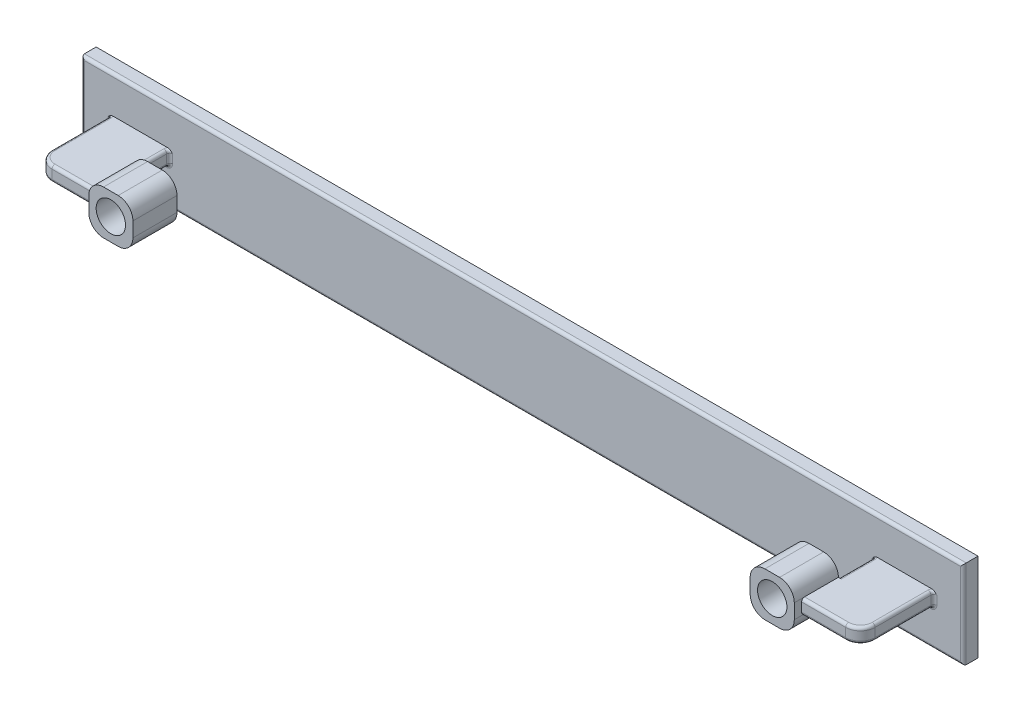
ISO-10303-21;
HEADER;
FILE_DESCRIPTION(('STEP AP214'),'2;1');
FILE_NAME('part.step','',(''),(''),'','','');
FILE_SCHEMA(('AUTOMOTIVE_DESIGN { 1 0 10303 214 1 1 1 1 }'));
ENDSEC;
DATA;
#1=APPLICATION_CONTEXT('core data for automotive mechanical design processes');
#2=APPLICATION_PROTOCOL_DEFINITION('international standard','automotive_design',2000,#1);
#3=PRODUCT_CONTEXT('',#1,'mechanical');
#4=PRODUCT('Part','Part','',(#3));
#5=PRODUCT_RELATED_PRODUCT_CATEGORY('part','',(#4));
#6=PRODUCT_DEFINITION_FORMATION('','',#4);
#7=PRODUCT_DEFINITION_CONTEXT('part definition',#1,'design');
#8=PRODUCT_DEFINITION('design','',#6,#7);
#9=PRODUCT_DEFINITION_SHAPE('','',#8);
#10=(LENGTH_UNIT() NAMED_UNIT(*) SI_UNIT(.MILLI.,.METRE.));
#11=(NAMED_UNIT(*) PLANE_ANGLE_UNIT() SI_UNIT($,.RADIAN.));
#12=(NAMED_UNIT(*) SI_UNIT($,.STERADIAN.) SOLID_ANGLE_UNIT());
#13=UNCERTAINTY_MEASURE_WITH_UNIT(LENGTH_MEASURE(1.E-05),#10,'distance_accuracy_value','');
#14=(GEOMETRIC_REPRESENTATION_CONTEXT(3) GLOBAL_UNCERTAINTY_ASSIGNED_CONTEXT((#13)) GLOBAL_UNIT_ASSIGNED_CONTEXT((#10,
#11,#12)) REPRESENTATION_CONTEXT('',''));
#15=CARTESIAN_POINT('',(0.,0.,0.));
#16=DIRECTION('',(0.,0.,1.));
#17=DIRECTION('',(1.,0.,0.));
#18=AXIS2_PLACEMENT_3D('',#15,#16,#17);
#19=CARTESIAN_POINT('',(210.,-15.,35.));
#20=DIRECTION('',(0.,0.,-1.));
#21=DIRECTION('',(-1.,0.,0.));
#22=AXIS2_PLACEMENT_3D('',#19,#20,#21);
#23=PLANE('',#22);
#24=DIRECTION('',(0.,1.,0.));
#25=VECTOR('',#24,1.);
#26=CARTESIAN_POINT('',(240.,-15.,35.));
#27=LINE('',#26,#25);
#28=CARTESIAN_POINT('',(240.,-3.,35.));
#29=VERTEX_POINT('',#28);
#30=CARTESIAN_POINT('',(240.,3.,35.));
#31=VERTEX_POINT('',#30);
#32=EDGE_CURVE('E933',#29,#31,#27,.T.);
#33=ORIENTED_EDGE('',*,*,#32,.F.);
#34=CARTESIAN_POINT('',(242.,-3.,35.));
#35=DIRECTION('',(0.,0.,-1.));
#36=DIRECTION('',(-1.,0.,0.));
#37=AXIS2_PLACEMENT_3D('',#34,#35,#36);
#38=CIRCLE('',#37,2.);
#39=CARTESIAN_POINT('',(242.,-5.,35.));
#40=VERTEX_POINT('',#39);
#41=EDGE_CURVE('E1108',#29,#40,#38,.F.);
#42=ORIENTED_EDGE('',*,*,#41,.T.);
#43=DIRECTION('',(1.,0.,0.));
#44=VECTOR('',#43,1.);
#45=CARTESIAN_POINT('',(280.,-5.,35.));
#46=LINE('',#45,#44);
#47=CARTESIAN_POINT('',(240.,-5.,35.));
#48=VERTEX_POINT('',#47);
#49=EDGE_CURVE('E1095',#48,#40,#46,.T.);
#50=ORIENTED_EDGE('',*,*,#49,.F.);
#51=CARTESIAN_POINT('',(230.,-5.,35.));
#52=DIRECTION('',(0.,0.,-1.));
#53=DIRECTION('',(-1.,0.,0.));
#54=AXIS2_PLACEMENT_3D('',#51,#52,#53);
#55=CIRCLE('',#54,10.);
#56=CARTESIAN_POINT('',(230.,-15.,35.));
#57=VERTEX_POINT('',#56);
#58=EDGE_CURVE('E438',#48,#57,#55,.T.);
#59=ORIENTED_EDGE('',*,*,#58,.T.);
#60=DIRECTION('',(1.,0.,0.));
#61=VECTOR('',#60,1.);
#62=CARTESIAN_POINT('',(210.,-15.,35.));
#63=LINE('',#62,#61);
#64=CARTESIAN_POINT('',(220.,-15.,35.));
#65=VERTEX_POINT('',#64);
#66=EDGE_CURVE('E944',#65,#57,#63,.T.);
#67=ORIENTED_EDGE('',*,*,#66,.F.);
#68=CARTESIAN_POINT('',(220.,-5.,35.));
#69=DIRECTION('',(0.,0.,-1.));
#70=DIRECTION('',(-1.,0.,0.));
#71=AXIS2_PLACEMENT_3D('',#68,#69,#70);
#72=CIRCLE('',#71,10.);
#73=CARTESIAN_POINT('',(210.,-5.,35.));
#74=VERTEX_POINT('',#73);
#75=EDGE_CURVE('E432',#65,#74,#72,.T.);
#76=ORIENTED_EDGE('',*,*,#75,.T.);
#77=DIRECTION('',(0.,1.,0.));
#78=VECTOR('',#77,1.);
#79=CARTESIAN_POINT('',(210.,-15.,35.));
#80=LINE('',#79,#78);
#81=CARTESIAN_POINT('',(210.,5.,35.));
#82=VERTEX_POINT('',#81);
#83=EDGE_CURVE('E938',#74,#82,#80,.T.);
#84=ORIENTED_EDGE('',*,*,#83,.T.);
#85=CARTESIAN_POINT('',(220.,5.,35.));
#86=DIRECTION('',(0.,0.,-1.));
#87=DIRECTION('',(-1.,0.,0.));
#88=AXIS2_PLACEMENT_3D('',#85,#86,#87);
#89=CIRCLE('',#88,10.);
#90=CARTESIAN_POINT('',(220.,15.,35.));
#91=VERTEX_POINT('',#90);
#92=EDGE_CURVE('E429',#82,#91,#89,.T.);
#93=ORIENTED_EDGE('',*,*,#92,.T.);
#94=DIRECTION('',(1.,0.,0.));
#95=VECTOR('',#94,1.);
#96=CARTESIAN_POINT('',(210.,15.,35.));
#97=LINE('',#96,#95);
#98=CARTESIAN_POINT('',(230.,15.,35.));
#99=VERTEX_POINT('',#98);
#100=EDGE_CURVE('E428',#91,#99,#97,.T.);
#101=ORIENTED_EDGE('',*,*,#100,.T.);
#102=CARTESIAN_POINT('',(230.,5.,35.));
#103=DIRECTION('',(0.,0.,-1.));
#104=DIRECTION('',(-1.,0.,0.));
#105=AXIS2_PLACEMENT_3D('',#102,#103,#104);
#106=CIRCLE('',#105,10.);
#107=CARTESIAN_POINT('',(240.,5.,35.));
#108=VERTEX_POINT('',#107);
#109=EDGE_CURVE('E418',#99,#108,#106,.T.);
#110=ORIENTED_EDGE('',*,*,#109,.T.);
#111=DIRECTION('',(-1.,0.,0.));
#112=VECTOR('',#111,1.);
#113=CARTESIAN_POINT('',(210.,5.,35.));
#114=LINE('',#113,#112);
#115=CARTESIAN_POINT('',(242.,5.,35.));
#116=VERTEX_POINT('',#115);
#117=EDGE_CURVE('E403',#116,#108,#114,.T.);
#118=ORIENTED_EDGE('',*,*,#117,.F.);
#119=CARTESIAN_POINT('',(242.,3.,35.));
#120=DIRECTION('',(0.,0.,-1.));
#121=DIRECTION('',(-1.,0.,0.));
#122=AXIS2_PLACEMENT_3D('',#119,#120,#121);
#123=CIRCLE('',#122,2.);
#124=EDGE_CURVE('E11',#116,#31,#123,.F.);
#125=ORIENTED_EDGE('',*,*,#124,.T.);
#126=EDGE_LOOP('',(#33,#42,#50,#59,#67,#76,#84,#93,#101,#110,#118,#125));
#127=FACE_BOUND('',#126,.T.);
#128=CARTESIAN_POINT('',(225.,0.,35.));
#129=DIRECTION('',(0.,0.,-1.));
#130=DIRECTION('',(-1.,0.,0.));
#131=AXIS2_PLACEMENT_3D('',#128,#129,#130);
#132=CIRCLE('',#131,9.99999999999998);
#133=CARTESIAN_POINT('',(215.,0.,35.));
#134=VERTEX_POINT('',#133);
#135=EDGE_CURVE('E924',#134,#134,#132,.T.);
#136=ORIENTED_EDGE('',*,*,#135,.F.);
#137=EDGE_LOOP('',(#136));
#138=FACE_BOUND('',#137,.T.);
#139=ADVANCED_FACE('F32',(#127,#138),#23,.T.);
#140=CARTESIAN_POINT('',(210.,-15.,65.));
#141=DIRECTION('',(0.,0.,-1.));
#142=DIRECTION('',(-1.,0.,0.));
#143=AXIS2_PLACEMENT_3D('',#140,#141,#142);
#144=PLANE('',#143);
#145=DIRECTION('',(1.,0.,0.));
#146=VECTOR('',#145,1.);
#147=CARTESIAN_POINT('',(210.,-15.,65.));
#148=LINE('',#147,#146);
#149=CARTESIAN_POINT('',(220.,-15.,65.));
#150=VERTEX_POINT('',#149);
#151=CARTESIAN_POINT('',(230.,-15.,65.));
#152=VERTEX_POINT('',#151);
#153=EDGE_CURVE('E947',#150,#152,#148,.T.);
#154=ORIENTED_EDGE('',*,*,#153,.T.);
#155=CARTESIAN_POINT('',(230.,-5.,65.));
#156=DIRECTION('',(0.,0.,-1.));
#157=DIRECTION('',(-1.,0.,0.));
#158=AXIS2_PLACEMENT_3D('',#155,#156,#157);
#159=CIRCLE('',#158,10.);
#160=CARTESIAN_POINT('',(240.,-5.,65.));
#161=VERTEX_POINT('',#160);
#162=EDGE_CURVE('E451',#152,#161,#159,.F.);
#163=ORIENTED_EDGE('',*,*,#162,.T.);
#164=DIRECTION('',(0.,1.,0.));
#165=VECTOR('',#164,1.);
#166=CARTESIAN_POINT('',(240.,-15.,65.));
#167=LINE('',#166,#165);
#168=CARTESIAN_POINT('',(240.,5.,65.));
#169=VERTEX_POINT('',#168);
#170=EDGE_CURVE('E930',#161,#169,#167,.T.);
#171=ORIENTED_EDGE('',*,*,#170,.T.);
#172=CARTESIAN_POINT('',(230.,5.,65.));
#173=DIRECTION('',(0.,0.,-1.));
#174=DIRECTION('',(-1.,0.,0.));
#175=AXIS2_PLACEMENT_3D('',#172,#173,#174);
#176=CIRCLE('',#175,10.);
#177=CARTESIAN_POINT('',(230.,15.,65.));
#178=VERTEX_POINT('',#177);
#179=EDGE_CURVE('E445',#169,#178,#176,.F.);
#180=ORIENTED_EDGE('',*,*,#179,.T.);
#181=DIRECTION('',(1.,0.,0.));
#182=VECTOR('',#181,1.);
#183=CARTESIAN_POINT('',(210.,15.,65.));
#184=LINE('',#183,#182);
#185=CARTESIAN_POINT('',(220.,15.,65.));
#186=VERTEX_POINT('',#185);
#187=EDGE_CURVE('E941',#186,#178,#184,.T.);
#188=ORIENTED_EDGE('',*,*,#187,.F.);
#189=CARTESIAN_POINT('',(220.,5.,65.));
#190=DIRECTION('',(0.,0.,-1.));
#191=DIRECTION('',(-1.,0.,0.));
#192=AXIS2_PLACEMENT_3D('',#189,#190,#191);
#193=CIRCLE('',#192,10.);
#194=CARTESIAN_POINT('',(210.,5.,65.));
#195=VERTEX_POINT('',#194);
#196=EDGE_CURVE('E447',#186,#195,#193,.F.);
#197=ORIENTED_EDGE('',*,*,#196,.T.);
#198=DIRECTION('',(0.,1.,0.));
#199=VECTOR('',#198,1.);
#200=CARTESIAN_POINT('',(210.,-15.,65.));
#201=LINE('',#200,#199);
#202=CARTESIAN_POINT('',(210.,-5.,65.));
#203=VERTEX_POINT('',#202);
#204=EDGE_CURVE('E935',#203,#195,#201,.T.);
#205=ORIENTED_EDGE('',*,*,#204,.F.);
#206=CARTESIAN_POINT('',(220.,-5.,65.));
#207=DIRECTION('',(0.,0.,-1.));
#208=DIRECTION('',(-1.,0.,0.));
#209=AXIS2_PLACEMENT_3D('',#206,#207,#208);
#210=CIRCLE('',#209,10.);
#211=EDGE_CURVE('E449',#203,#150,#210,.F.);
#212=ORIENTED_EDGE('',*,*,#211,.T.);
#213=EDGE_LOOP('',(#154,#163,#171,#180,#188,#197,#205,#212));
#214=FACE_BOUND('',#213,.T.);
#215=CARTESIAN_POINT('',(225.,0.,65.));
#216=DIRECTION('',(0.,0.,-1.));
#217=DIRECTION('',(-1.,0.,0.));
#218=AXIS2_PLACEMENT_3D('',#215,#216,#217);
#219=CIRCLE('',#218,9.99999999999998);
#220=CARTESIAN_POINT('',(215.,0.,65.));
#221=VERTEX_POINT('',#220);
#222=EDGE_CURVE('E927',#221,#221,#219,.T.);
#223=ORIENTED_EDGE('',*,*,#222,.T.);
#224=EDGE_LOOP('',(#223));
#225=FACE_BOUND('',#224,.T.);
#226=ADVANCED_FACE('F746',(#214,#225),#144,.F.);
#227=CARTESIAN_POINT('',(-240.,5.,60.));
#228=DIRECTION('',(1.,0.,0.));
#229=DIRECTION('',(0.,0.,-1.));
#230=AXIS2_PLACEMENT_3D('',#227,#228,#229);
#231=PLANE('',#230);
#232=DIRECTION('',(0.,-1.,0.));
#233=VECTOR('',#232,1.);
#234=CARTESIAN_POINT('',(-240.,5.,12.));
#235=LINE('',#234,#233);
#236=CARTESIAN_POINT('',(-240.,-3.,12.));
#237=VERTEX_POINT('',#236);
#238=CARTESIAN_POINT('',(-240.,3.,12.));
#239=VERTEX_POINT('',#238);
#240=EDGE_CURVE('E499',#237,#239,#235,.F.);
#241=ORIENTED_EDGE('',*,*,#240,.T.);
#242=DIRECTION('',(0.,0.,-1.));
#243=VECTOR('',#242,1.);
#244=CARTESIAN_POINT('',(-240.,3.,60.));
#245=LINE('',#244,#243);
#246=CARTESIAN_POINT('',(-240.,3.,35.));
#247=VERTEX_POINT('',#246);
#248=EDGE_CURVE('E551',#239,#247,#245,.F.);
#249=ORIENTED_EDGE('',*,*,#248,.T.);
#250=DIRECTION('',(0.,1.,0.));
#251=VECTOR('',#250,1.);
#252=CARTESIAN_POINT('',(-240.,-15.,35.));
#253=LINE('',#252,#251);
#254=CARTESIAN_POINT('',(-240.,-3.,35.));
#255=VERTEX_POINT('',#254);
#256=EDGE_CURVE('E962',#255,#247,#253,.T.);
#257=ORIENTED_EDGE('',*,*,#256,.F.);
#258=DIRECTION('',(0.,0.,-1.));
#259=VECTOR('',#258,1.);
#260=CARTESIAN_POINT('',(-240.,-3.,60.));
#261=LINE('',#260,#259);
#262=EDGE_CURVE('E497',#255,#237,#261,.T.);
#263=ORIENTED_EDGE('',*,*,#262,.T.);
#264=EDGE_LOOP('',(#241,#249,#257,#263));
#265=FACE_BOUND('',#264,.T.);
#266=ADVANCED_FACE('F576',(#265),#231,.T.);
#267=CARTESIAN_POINT('',(-300.,-30.,10.));
#268=DIRECTION('',(0.,0.,-1.));
#269=DIRECTION('',(-1.,0.,0.));
#270=AXIS2_PLACEMENT_3D('',#267,#268,#269);
#271=PLANE('',#270);
#272=DIRECTION('',(-1.,0.,0.));
#273=VECTOR('',#272,1.);
#274=CARTESIAN_POINT('',(280.,5.,10.));
#275=LINE('',#274,#273);
#276=CARTESIAN_POINT('',(278.535898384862,5.,10.));
#277=VERTEX_POINT('',#276);
#278=CARTESIAN_POINT('',(241.464101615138,5.,10.));
#279=VERTEX_POINT('',#278);
#280=EDGE_CURVE('E943',#277,#279,#275,.T.);
#281=ORIENTED_EDGE('',*,*,#280,.F.);
#282=CARTESIAN_POINT('',(278.535898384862,5.,10.));
#283=CARTESIAN_POINT('',(278.621593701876,5.00001184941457,10.));
#284=CARTESIAN_POINT('',(278.707238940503,4.99587106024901,10.));
#285=CARTESIAN_POINT('',(278.877678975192,4.97985293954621,10.));
#286=CARTESIAN_POINT('',(278.962474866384,4.96798738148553,10.));
#287=CARTESIAN_POINT('',(279.129716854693,4.93727122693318,10.));
#288=CARTESIAN_POINT('',(279.212178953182,4.9185064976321,10.));
#289=CARTESIAN_POINT('',(279.375401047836,4.87456117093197,10.));
#290=CARTESIAN_POINT('',(279.45616021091,4.8493775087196,10.));
#291=CARTESIAN_POINT('',(279.645267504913,4.78275294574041,10.));
#292=CARTESIAN_POINT('',(279.752715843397,4.73874838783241,10.));
#293=CARTESIAN_POINT('',(279.963307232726,4.64135428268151,10.));
#294=CARTESIAN_POINT('',(280.066446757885,4.58795722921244,10.));
#295=CARTESIAN_POINT('',(280.370001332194,4.41546245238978,10.));
#296=CARTESIAN_POINT('',(280.563631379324,4.28440934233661,10.));
#297=CARTESIAN_POINT('',(280.973116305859,3.97275976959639,10.));
#298=CARTESIAN_POINT('',(281.185284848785,3.78752251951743,10.));
#299=CARTESIAN_POINT('',(281.596216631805,3.40364154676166,10.));
#300=CARTESIAN_POINT('',(281.794990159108,3.20500835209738,10.));
#301=CARTESIAN_POINT('',(281.995783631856,3.00421636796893,10.));
#302=CARTESIAN_POINT('',(281.997891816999,3.0021081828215,10.));
#303=CARTESIAN_POINT('',(282.,3.,10.));
#304=B_SPLINE_CURVE_WITH_KNOTS('',3,(#282,#283,#284,#285,#286,#287,#288,#289,#290,#291,#292,
#293,#294,#295,#296,#297,#298,#299,#300,#301,#302,#303),.UNSPECIFIED.,.F.,.F.,(4,2,2,2,2,2,2,2,
2,2,4),(0.,0.256912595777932,0.513434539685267,0.766866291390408,1.02041927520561,
1.36819331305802,1.71624655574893,2.41527069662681,3.25887239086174,4.10181864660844,
4.11076291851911),.UNSPECIFIED.);
#305=CARTESIAN_POINT('',(282.,3.,10.));
#306=VERTEX_POINT('',#305);
#307=EDGE_CURVE('E586',#277,#306,#304,.T.);
#308=ORIENTED_EDGE('',*,*,#307,.T.);
#309=DIRECTION('',(0.,-1.,0.));
#310=VECTOR('',#309,1.);
#311=CARTESIAN_POINT('',(282.,-30.,10.));
#312=LINE('',#311,#310);
#313=CARTESIAN_POINT('',(282.,-3.,10.));
#314=VERTEX_POINT('',#313);
#315=EDGE_CURVE('E1165',#306,#314,#312,.T.);
#316=ORIENTED_EDGE('',*,*,#315,.T.);
#317=CARTESIAN_POINT('',(278.,-3.,10.));
#318=DIRECTION('',(0.,0.,-1.));
#319=DIRECTION('',(-1.,0.,0.));
#320=AXIS2_PLACEMENT_3D('',#317,#318,#319);
#321=CIRCLE('',#320,4.);
#322=CARTESIAN_POINT('',(278.,-7.,10.));
#323=VERTEX_POINT('',#322);
#324=EDGE_CURVE('E1167',#323,#314,#321,.F.);
#325=ORIENTED_EDGE('',*,*,#324,.F.);
#326=DIRECTION('',(-1.,0.,0.));
#327=VECTOR('',#326,1.);
#328=CARTESIAN_POINT('',(-300.,-7.,10.));
#329=LINE('',#328,#327);
#330=CARTESIAN_POINT('',(242.,-7.,10.));
#331=VERTEX_POINT('',#330);
#332=EDGE_CURVE('E1173',#323,#331,#329,.T.);
#333=ORIENTED_EDGE('',*,*,#332,.T.);
#334=CARTESIAN_POINT('',(242.,-3.,10.));
#335=DIRECTION('',(0.,0.,-1.));
#336=DIRECTION('',(-1.,0.,0.));
#337=AXIS2_PLACEMENT_3D('',#334,#335,#336);
#338=CIRCLE('',#337,4.);
#339=CARTESIAN_POINT('',(238.,-3.,10.));
#340=VERTEX_POINT('',#339);
#341=EDGE_CURVE('E1175',#340,#331,#338,.F.);
#342=ORIENTED_EDGE('',*,*,#341,.F.);
#343=DIRECTION('',(0.,-1.,0.));
#344=VECTOR('',#343,1.);
#345=CARTESIAN_POINT('',(238.,5.,10.));
#346=LINE('',#345,#344);
#347=CARTESIAN_POINT('',(238.,3.,10.));
#348=VERTEX_POINT('',#347);
#349=EDGE_CURVE('E1129',#340,#348,#346,.F.);
#350=ORIENTED_EDGE('',*,*,#349,.T.);
#351=CARTESIAN_POINT('',(241.464101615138,5.,10.));
#352=CARTESIAN_POINT('',(241.378406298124,5.00001184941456,10.));
#353=CARTESIAN_POINT('',(241.292761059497,4.99587106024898,10.));
#354=CARTESIAN_POINT('',(241.122321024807,4.97985293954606,10.));
#355=CARTESIAN_POINT('',(241.037525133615,4.96798738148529,10.));
#356=CARTESIAN_POINT('',(240.870283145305,4.93727122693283,10.));
#357=CARTESIAN_POINT('',(240.787821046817,4.91850649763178,10.));
#358=CARTESIAN_POINT('',(240.624598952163,4.87456117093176,10.));
#359=CARTESIAN_POINT('',(240.543839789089,4.84937750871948,10.));
#360=CARTESIAN_POINT('',(240.354732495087,4.78275294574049,10.));
#361=CARTESIAN_POINT('',(240.247284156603,4.73874838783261,10.));
#362=CARTESIAN_POINT('',(240.036692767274,4.6413542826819,10.));
#363=CARTESIAN_POINT('',(239.933553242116,4.5879572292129,10.));
#364=CARTESIAN_POINT('',(239.629998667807,4.41546245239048,10.));
#365=CARTESIAN_POINT('',(239.436368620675,4.28440934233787,10.));
#366=CARTESIAN_POINT('',(239.026883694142,3.97275976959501,10.));
#367=CARTESIAN_POINT('',(238.81471515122,3.78752251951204,10.));
#368=CARTESIAN_POINT('',(238.403783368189,3.40364154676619,9.99999999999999));
#369=CARTESIAN_POINT('',(238.205009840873,3.20500835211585,9.99999999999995));
#370=CARTESIAN_POINT('',(238.004216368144,3.00421636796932,10.));
#371=CARTESIAN_POINT('',(238.002108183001,3.00210818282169,10.));
#372=CARTESIAN_POINT('',(238.,3.,10.));
#373=B_SPLINE_CURVE_WITH_KNOTS('',3,(#351,#352,#353,#354,#355,#356,#357,#358,#359,#360,#361,
#362,#363,#364,#365,#366,#367,#368,#369,#370,#371,#372),.UNSPECIFIED.,.F.,.F.,(4,2,2,2,2,2,2,2,
2,2,4),(0.,0.256912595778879,0.513434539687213,0.766866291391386,1.02041927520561,
1.36819331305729,1.7162465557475,2.41527069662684,3.2588723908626,4.10181864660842,
4.11076291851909),.UNSPECIFIED.);
#374=EDGE_CURVE('E41',#348,#279,#373,.F.);
#375=ORIENTED_EDGE('',*,*,#374,.T.);
#376=EDGE_LOOP('',(#281,#308,#316,#325,#333,#342,#350,#375));
#377=FACE_BOUND('',#376,.T.);
#378=DIRECTION('',(1.,0.,0.));
#379=VECTOR('',#378,1.);
#380=CARTESIAN_POINT('',(-300.,28.,10.));
#381=LINE('',#380,#379);
#382=CARTESIAN_POINT('',(298.,28.,10.));
#383=VERTEX_POINT('',#382);
#384=CARTESIAN_POINT('',(-298.,28.,10.));
#385=VERTEX_POINT('',#384);
#386=EDGE_CURVE('E466',#383,#385,#381,.F.);
#387=ORIENTED_EDGE('',*,*,#386,.T.);
#388=DIRECTION('',(0.,-1.,0.));
#389=VECTOR('',#388,1.);
#390=CARTESIAN_POINT('',(-298.,-30.,10.));
#391=LINE('',#390,#389);
#392=CARTESIAN_POINT('',(-298.,-28.,10.));
#393=VERTEX_POINT('',#392);
#394=EDGE_CURVE('E468',#385,#393,#391,.T.);
#395=ORIENTED_EDGE('',*,*,#394,.T.);
#396=DIRECTION('',(-1.,0.,0.));
#397=VECTOR('',#396,1.);
#398=CARTESIAN_POINT('',(300.,-28.,10.));
#399=LINE('',#398,#397);
#400=CARTESIAN_POINT('',(298.,-28.,10.));
#401=VERTEX_POINT('',#400);
#402=EDGE_CURVE('E462',#393,#401,#399,.F.);
#403=ORIENTED_EDGE('',*,*,#402,.T.);
#404=DIRECTION('',(0.,-1.,0.));
#405=VECTOR('',#404,1.);
#406=CARTESIAN_POINT('',(298.,30.,10.));
#407=LINE('',#406,#405);
#408=EDGE_CURVE('E464',#401,#383,#407,.F.);
#409=ORIENTED_EDGE('',*,*,#408,.T.);
#410=EDGE_LOOP('',(#387,#395,#403,#409));
#411=FACE_BOUND('',#410,.T.);
#412=DIRECTION('',(0.,-1.,0.));
#413=VECTOR('',#412,1.);
#414=CARTESIAN_POINT('',(-282.,5.,10.));
#415=LINE('',#414,#413);
#416=CARTESIAN_POINT('',(-282.,-3.,10.));
#417=VERTEX_POINT('',#416);
#418=CARTESIAN_POINT('',(-282.,3.,10.));
#419=VERTEX_POINT('',#418);
#420=EDGE_CURVE('E494',#417,#419,#415,.F.);
#421=ORIENTED_EDGE('',*,*,#420,.T.);
#422=CARTESIAN_POINT('',(-278.535898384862,5.,10.));
#423=CARTESIAN_POINT('',(-278.621593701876,5.00001184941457,10.));
#424=CARTESIAN_POINT('',(-278.707238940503,4.99587106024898,10.));
#425=CARTESIAN_POINT('',(-278.877678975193,4.97985293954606,10.));
#426=CARTESIAN_POINT('',(-278.962474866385,4.96798738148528,10.));
#427=CARTESIAN_POINT('',(-279.129716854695,4.93727122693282,10.));
#428=CARTESIAN_POINT('',(-279.212178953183,4.91850649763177,10.));
#429=CARTESIAN_POINT('',(-279.375401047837,4.87456117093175,10.));
#430=CARTESIAN_POINT('',(-279.456160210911,4.84937750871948,10.));
#431=CARTESIAN_POINT('',(-279.645267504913,4.7827529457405,10.));
#432=CARTESIAN_POINT('',(-279.752715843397,4.73874838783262,10.));
#433=CARTESIAN_POINT('',(-279.963307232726,4.64135428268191,10.));
#434=CARTESIAN_POINT('',(-280.066446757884,4.5879572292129,10.));
#435=CARTESIAN_POINT('',(-280.370001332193,4.41546245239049,10.));
#436=CARTESIAN_POINT('',(-280.563631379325,4.28440934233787,10.));
#437=CARTESIAN_POINT('',(-280.973116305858,3.97275976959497,10.));
#438=CARTESIAN_POINT('',(-281.18528484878,3.78752251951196,10.));
#439=CARTESIAN_POINT('',(-281.596216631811,3.40364154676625,9.99999999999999));
#440=CARTESIAN_POINT('',(-281.794990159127,3.20500835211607,9.99999999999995));
#441=CARTESIAN_POINT('',(-281.995783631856,3.00421636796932,10.));
#442=CARTESIAN_POINT('',(-281.997891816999,3.00210818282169,10.));
#443=CARTESIAN_POINT('',(-282.,3.,10.));
#444=B_SPLINE_CURVE_WITH_KNOTS('',3,(#422,#423,#424,#425,#426,#427,#428,#429,#430,#431,#432,
#433,#434,#435,#436,#437,#438,#439,#440,#441,#442,#443),.UNSPECIFIED.,.F.,.F.,(4,2,2,2,2,2,2,2,
2,2,4),(0.,0.256912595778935,0.513434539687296,0.766866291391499,1.02041927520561,
1.36819331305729,1.71624655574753,2.41527069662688,3.25887239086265,4.10181864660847,
4.11076291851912),.UNSPECIFIED.);
#445=CARTESIAN_POINT('',(-278.535898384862,5.,10.));
#446=VERTEX_POINT('',#445);
#447=EDGE_CURVE('E553',#419,#446,#444,.F.);
#448=ORIENTED_EDGE('',*,*,#447,.T.);
#449=DIRECTION('',(1.,0.,0.));
#450=VECTOR('',#449,1.);
#451=CARTESIAN_POINT('',(-280.,5.,10.));
#452=LINE('',#451,#450);
#453=CARTESIAN_POINT('',(-241.464101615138,5.,10.));
#454=VERTEX_POINT('',#453);
#455=EDGE_CURVE('E978',#446,#454,#452,.T.);
#456=ORIENTED_EDGE('',*,*,#455,.T.);
#457=CARTESIAN_POINT('',(-241.464101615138,5.,9.99999999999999));
#458=CARTESIAN_POINT('',(-241.378406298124,5.00001184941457,10.));
#459=CARTESIAN_POINT('',(-241.292761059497,4.99587106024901,10.));
#460=CARTESIAN_POINT('',(-241.122321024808,4.97985293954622,10.));
#461=CARTESIAN_POINT('',(-241.037525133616,4.96798738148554,10.));
#462=CARTESIAN_POINT('',(-240.870283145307,4.93727122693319,10.));
#463=CARTESIAN_POINT('',(-240.787821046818,4.9185064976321,10.));
#464=CARTESIAN_POINT('',(-240.624598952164,4.87456117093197,10.));
#465=CARTESIAN_POINT('',(-240.54383978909,4.8493775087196,10.));
#466=CARTESIAN_POINT('',(-240.354732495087,4.78275294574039,10.));
#467=CARTESIAN_POINT('',(-240.247284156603,4.73874838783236,10.));
#468=CARTESIAN_POINT('',(-240.036692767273,4.64135428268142,10.));
#469=CARTESIAN_POINT('',(-239.933553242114,4.58795722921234,10.));
#470=CARTESIAN_POINT('',(-239.629998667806,4.4154624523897,10.));
#471=CARTESIAN_POINT('',(-239.436368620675,4.28440934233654,10.));
#472=CARTESIAN_POINT('',(-239.026883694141,3.97275976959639,10.));
#473=CARTESIAN_POINT('',(-238.814715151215,3.7875225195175,10.));
#474=CARTESIAN_POINT('',(-238.403783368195,3.40364154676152,10.));
#475=CARTESIAN_POINT('',(-238.205009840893,3.20500835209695,10.));
#476=CARTESIAN_POINT('',(-238.004216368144,3.00421636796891,10.));
#477=CARTESIAN_POINT('',(-238.002108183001,3.00210818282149,10.));
#478=CARTESIAN_POINT('',(-238.,3.,10.));
#479=B_SPLINE_CURVE_WITH_KNOTS('',3,(#457,#458,#459,#460,#461,#462,#463,#464,#465,#466,#467,
#468,#469,#470,#471,#472,#473,#474,#475,#476,#477,#478),.UNSPECIFIED.,.F.,.F.,(4,2,2,2,2,2,2,2,
2,2,4),(0.,0.256912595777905,0.513434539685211,0.766866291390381,1.02041927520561,
1.36819331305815,1.71624655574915,2.41527069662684,3.25887239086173,4.10181864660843,
4.11076291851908),.UNSPECIFIED.);
#480=CARTESIAN_POINT('',(-238.,3.,10.));
#481=VERTEX_POINT('',#480);
#482=EDGE_CURVE('E560',#454,#481,#479,.T.);
#483=ORIENTED_EDGE('',*,*,#482,.T.);
#484=DIRECTION('',(0.,-1.,0.));
#485=VECTOR('',#484,1.);
#486=CARTESIAN_POINT('',(-238.,-30.,10.));
#487=LINE('',#486,#485);
#488=CARTESIAN_POINT('',(-238.,-3.,10.));
#489=VERTEX_POINT('',#488);
#490=EDGE_CURVE('E492',#481,#489,#487,.T.);
#491=ORIENTED_EDGE('',*,*,#490,.T.);
#492=CARTESIAN_POINT('',(-242.,-3.,10.));
#493=DIRECTION('',(0.,0.,-1.));
#494=DIRECTION('',(-1.,0.,0.));
#495=AXIS2_PLACEMENT_3D('',#492,#493,#494);
#496=CIRCLE('',#495,4.);
#497=CARTESIAN_POINT('',(-242.,-7.,10.));
#498=VERTEX_POINT('',#497);
#499=EDGE_CURVE('E489',#498,#489,#496,.F.);
#500=ORIENTED_EDGE('',*,*,#499,.F.);
#501=DIRECTION('',(1.,0.,0.));
#502=VECTOR('',#501,1.);
#503=CARTESIAN_POINT('',(-280.,-7.,10.));
#504=LINE('',#503,#502);
#505=CARTESIAN_POINT('',(-278.,-7.,10.));
#506=VERTEX_POINT('',#505);
#507=EDGE_CURVE('E487',#498,#506,#504,.F.);
#508=ORIENTED_EDGE('',*,*,#507,.T.);
#509=CARTESIAN_POINT('',(-278.,-3.,10.));
#510=DIRECTION('',(0.,0.,-1.));
#511=DIRECTION('',(-1.,0.,0.));
#512=AXIS2_PLACEMENT_3D('',#509,#510,#511);
#513=CIRCLE('',#512,4.);
#514=EDGE_CURVE('E484',#417,#506,#513,.F.);
#515=ORIENTED_EDGE('',*,*,#514,.F.);
#516=EDGE_LOOP('',(#421,#448,#456,#483,#491,#500,#508,#515));
#517=FACE_BOUND('',#516,.T.);
#518=ADVANCED_FACE('F570',(#377,#411,#517),#271,.F.);
#519=CARTESIAN_POINT('',(-300.,30.,10.));
#520=DIRECTION('',(1.,0.,0.));
#521=DIRECTION('',(0.,0.,-1.));
#522=AXIS2_PLACEMENT_3D('',#519,#520,#521);
#523=PLANE('',#522);
#524=DIRECTION('',(0.,0.,-1.));
#525=VECTOR('',#524,1.);
#526=CARTESIAN_POINT('',(-300.,-30.,10.));
#527=LINE('',#526,#525);
#528=CARTESIAN_POINT('',(-300.,-30.,8.));
#529=VERTEX_POINT('',#528);
#530=CARTESIAN_POINT('',(-300.,-30.,0.));
#531=VERTEX_POINT('',#530);
#532=EDGE_CURVE('E1007',#529,#531,#527,.T.);
#533=ORIENTED_EDGE('',*,*,#532,.F.);
#534=DIRECTION('',(0.,-1.,0.));
#535=VECTOR('',#534,1.);
#536=CARTESIAN_POINT('',(-300.,30.,8.));
#537=LINE('',#536,#535);
#538=CARTESIAN_POINT('',(-300.,30.,8.));
#539=VERTEX_POINT('',#538);
#540=EDGE_CURVE('E471',#529,#539,#537,.F.);
#541=ORIENTED_EDGE('',*,*,#540,.T.);
#542=DIRECTION('',(0.,0.,-1.));
#543=VECTOR('',#542,1.);
#544=CARTESIAN_POINT('',(-300.,30.,10.));
#545=LINE('',#544,#543);
#546=CARTESIAN_POINT('',(-300.,30.,0.));
#547=VERTEX_POINT('',#546);
#548=EDGE_CURVE('E1001',#539,#547,#545,.T.);
#549=ORIENTED_EDGE('',*,*,#548,.T.);
#550=DIRECTION('',(0.,-1.,0.));
#551=VECTOR('',#550,1.);
#552=CARTESIAN_POINT('',(-300.,30.,0.));
#553=LINE('',#552,#551);
#554=EDGE_CURVE('E989',#547,#531,#553,.T.);
#555=ORIENTED_EDGE('',*,*,#554,.T.);
#556=EDGE_LOOP('',(#533,#541,#549,#555));
#557=FACE_BOUND('',#556,.T.);
#558=ADVANCED_FACE('F575',(#557),#523,.F.);
#559=CARTESIAN_POINT('',(300.,-30.,10.));
#560=DIRECTION('',(0.,-1.,0.));
#561=DIRECTION('',(0.,0.,-1.));
#562=AXIS2_PLACEMENT_3D('',#559,#560,#561);
#563=PLANE('',#562);
#564=DIRECTION('',(0.,0.,-1.));
#565=VECTOR('',#564,1.);
#566=CARTESIAN_POINT('',(300.,-30.,10.));
#567=LINE('',#566,#565);
#568=CARTESIAN_POINT('',(300.,-30.,8.));
#569=VERTEX_POINT('',#568);
#570=CARTESIAN_POINT('',(300.,-30.,0.));
#571=VERTEX_POINT('',#570);
#572=EDGE_CURVE('E1005',#569,#571,#567,.T.);
#573=ORIENTED_EDGE('',*,*,#572,.F.);
#574=DIRECTION('',(-1.,0.,0.));
#575=VECTOR('',#574,1.);
#576=CARTESIAN_POINT('',(300.,-30.,8.));
#577=LINE('',#576,#575);
#578=EDGE_CURVE('E478',#569,#529,#577,.T.);
#579=ORIENTED_EDGE('',*,*,#578,.T.);
#580=ORIENTED_EDGE('',*,*,#532,.T.);
#581=DIRECTION('',(-1.,0.,0.));
#582=VECTOR('',#581,1.);
#583=CARTESIAN_POINT('',(300.,-30.,0.));
#584=LINE('',#583,#582);
#585=EDGE_CURVE('E992',#571,#531,#584,.T.);
#586=ORIENTED_EDGE('',*,*,#585,.F.);
#587=EDGE_LOOP('',(#573,#579,#580,#586));
#588=FACE_BOUND('',#587,.T.);
#589=ADVANCED_FACE('F1860',(#588),#563,.T.);
#590=CARTESIAN_POINT('',(300.,30.,10.));
#591=DIRECTION('',(1.,0.,0.));
#592=DIRECTION('',(0.,0.,-1.));
#593=AXIS2_PLACEMENT_3D('',#590,#591,#592);
#594=PLANE('',#593);
#595=DIRECTION('',(0.,0.,-1.));
#596=VECTOR('',#595,1.);
#597=CARTESIAN_POINT('',(300.,30.,10.));
#598=LINE('',#597,#596);
#599=CARTESIAN_POINT('',(300.,30.,8.));
#600=VERTEX_POINT('',#599);
#601=CARTESIAN_POINT('',(300.,30.,0.));
#602=VERTEX_POINT('',#601);
#603=EDGE_CURVE('E1003',#600,#602,#598,.T.);
#604=ORIENTED_EDGE('',*,*,#603,.F.);
#605=DIRECTION('',(0.,-1.,0.));
#606=VECTOR('',#605,1.);
#607=CARTESIAN_POINT('',(300.,30.,8.));
#608=LINE('',#607,#606);
#609=EDGE_CURVE('E476',#600,#569,#608,.T.);
#610=ORIENTED_EDGE('',*,*,#609,.T.);
#611=ORIENTED_EDGE('',*,*,#572,.T.);
#612=DIRECTION('',(0.,-1.,0.));
#613=VECTOR('',#612,1.);
#614=CARTESIAN_POINT('',(300.,30.,0.));
#615=LINE('',#614,#613);
#616=EDGE_CURVE('E995',#602,#571,#615,.T.);
#617=ORIENTED_EDGE('',*,*,#616,.F.);
#618=EDGE_LOOP('',(#604,#610,#611,#617));
#619=FACE_BOUND('',#618,.T.);
#620=ADVANCED_FACE('F1852',(#619),#594,.T.);
#621=CARTESIAN_POINT('',(-300.,30.,10.));
#622=DIRECTION('',(0.,1.,0.));
#623=DIRECTION('',(0.,0.,1.));
#624=AXIS2_PLACEMENT_3D('',#621,#622,#623);
#625=PLANE('',#624);
#626=ORIENTED_EDGE('',*,*,#548,.F.);
#627=DIRECTION('',(1.,0.,0.));
#628=VECTOR('',#627,1.);
#629=CARTESIAN_POINT('',(-300.,30.,8.));
#630=LINE('',#629,#628);
#631=EDGE_CURVE('E474',#539,#600,#630,.T.);
#632=ORIENTED_EDGE('',*,*,#631,.T.);
#633=ORIENTED_EDGE('',*,*,#603,.T.);
#634=DIRECTION('',(1.,0.,0.));
#635=VECTOR('',#634,1.);
#636=CARTESIAN_POINT('',(-300.,30.,0.));
#637=LINE('',#636,#635);
#638=EDGE_CURVE('E998',#547,#602,#637,.T.);
#639=ORIENTED_EDGE('',*,*,#638,.F.);
#640=EDGE_LOOP('',(#626,#632,#633,#639));
#641=FACE_BOUND('',#640,.T.);
#642=ADVANCED_FACE('F580',(#641),#625,.T.);
#643=CARTESIAN_POINT('',(-300.,-30.,0.));
#644=DIRECTION('',(0.,0.,-1.));
#645=DIRECTION('',(-1.,0.,0.));
#646=AXIS2_PLACEMENT_3D('',#643,#644,#645);
#647=PLANE('',#646);
#648=ORIENTED_EDGE('',*,*,#554,.F.);
#649=ORIENTED_EDGE('',*,*,#638,.T.);
#650=ORIENTED_EDGE('',*,*,#616,.T.);
#651=ORIENTED_EDGE('',*,*,#585,.T.);
#652=EDGE_LOOP('',(#648,#649,#650,#651));
#653=FACE_BOUND('',#652,.T.);
#654=ADVANCED_FACE('F578',(#653),#647,.T.);
#655=CARTESIAN_POINT('',(-280.,5.,60.));
#656=DIRECTION('',(1.,0.,0.));
#657=DIRECTION('',(0.,0.,-1.));
#658=AXIS2_PLACEMENT_3D('',#655,#656,#657);
#659=PLANE('',#658);
#660=DIRECTION('',(0.,-1.,0.));
#661=VECTOR('',#660,1.);
#662=CARTESIAN_POINT('',(-280.,-5.,50.));
#663=LINE('',#662,#661);
#664=CARTESIAN_POINT('',(-280.,-3.,50.));
#665=VERTEX_POINT('',#664);
#666=CARTESIAN_POINT('',(-280.,3.,50.));
#667=VERTEX_POINT('',#666);
#668=EDGE_CURVE('E1011',#665,#667,#663,.F.);
#669=ORIENTED_EDGE('',*,*,#668,.T.);
#670=DIRECTION('',(0.,0.,-1.));
#671=VECTOR('',#670,1.);
#672=CARTESIAN_POINT('',(-280.,3.,60.));
#673=LINE('',#672,#671);
#674=CARTESIAN_POINT('',(-280.,3.,12.));
#675=VERTEX_POINT('',#674);
#676=EDGE_CURVE('E545',#667,#675,#673,.T.);
#677=ORIENTED_EDGE('',*,*,#676,.T.);
#678=DIRECTION('',(0.,-1.,0.));
#679=VECTOR('',#678,1.);
#680=CARTESIAN_POINT('',(-280.,5.,12.));
#681=LINE('',#680,#679);
#682=CARTESIAN_POINT('',(-280.,-3.,12.));
#683=VERTEX_POINT('',#682);
#684=EDGE_CURVE('E482',#675,#683,#681,.T.);
#685=ORIENTED_EDGE('',*,*,#684,.T.);
#686=DIRECTION('',(0.,0.,-1.));
#687=VECTOR('',#686,1.);
#688=CARTESIAN_POINT('',(-280.,-3.,60.));
#689=LINE('',#688,#687);
#690=EDGE_CURVE('E480',#683,#665,#689,.F.);
#691=ORIENTED_EDGE('',*,*,#690,.T.);
#692=EDGE_LOOP('',(#669,#677,#685,#691));
#693=FACE_BOUND('',#692,.T.);
#694=ADVANCED_FACE('F1279',(#693),#659,.F.);
#695=CARTESIAN_POINT('',(-280.,-5.,60.));
#696=DIRECTION('',(0.,1.,0.));
#697=DIRECTION('',(0.,0.,1.));
#698=AXIS2_PLACEMENT_3D('',#695,#696,#697);
#699=PLANE('',#698);
#700=DIRECTION('',(1.,0.,0.));
#701=VECTOR('',#700,1.);
#702=CARTESIAN_POINT('',(-280.,-5.,35.));
#703=LINE('',#702,#701);
#704=CARTESIAN_POINT('',(-242.,-5.,35.));
#705=VERTEX_POINT('',#704);
#706=CARTESIAN_POINT('',(-241.832159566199,-5.,35.));
#707=VERTEX_POINT('',#706);
#708=EDGE_CURVE('E505',#705,#707,#703,.T.);
#709=ORIENTED_EDGE('',*,*,#708,.T.);
#710=DIRECTION('',(0.,0.,-1.));
#711=VECTOR('',#710,1.);
#712=CARTESIAN_POINT('',(-241.832159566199,-5.,60.));
#713=LINE('',#712,#711);
#714=CARTESIAN_POINT('',(-241.832159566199,-5.,58.));
#715=VERTEX_POINT('',#714);
#716=EDGE_CURVE('E1218',#707,#715,#713,.F.);
#717=ORIENTED_EDGE('',*,*,#716,.T.);
#718=DIRECTION('',(1.,0.,0.));
#719=VECTOR('',#718,1.);
#720=CARTESIAN_POINT('',(-280.,-5.,58.));
#721=LINE('',#720,#719);
#722=CARTESIAN_POINT('',(-270.,-5.,58.));
#723=VERTEX_POINT('',#722);
#724=EDGE_CURVE('E517',#715,#723,#721,.F.);
#725=ORIENTED_EDGE('',*,*,#724,.T.);
#726=CARTESIAN_POINT('',(-270.,-5.,50.));
#727=DIRECTION('',(0.,1.,0.));
#728=DIRECTION('',(0.,0.,1.));
#729=AXIS2_PLACEMENT_3D('',#726,#727,#728);
#730=CIRCLE('',#729,8.);
#731=CARTESIAN_POINT('',(-278.,-5.,50.));
#732=VERTEX_POINT('',#731);
#733=EDGE_CURVE('E515',#723,#732,#730,.F.);
#734=ORIENTED_EDGE('',*,*,#733,.T.);
#735=DIRECTION('',(0.,0.,-1.));
#736=VECTOR('',#735,1.);
#737=CARTESIAN_POINT('',(-278.,-5.,60.));
#738=LINE('',#737,#736);
#739=CARTESIAN_POINT('',(-278.,-5.,12.));
#740=VERTEX_POINT('',#739);
#741=EDGE_CURVE('E513',#732,#740,#738,.T.);
#742=ORIENTED_EDGE('',*,*,#741,.T.);
#743=DIRECTION('',(1.,0.,0.));
#744=VECTOR('',#743,1.);
#745=CARTESIAN_POINT('',(-280.,-5.,12.));
#746=LINE('',#745,#744);
#747=CARTESIAN_POINT('',(-242.,-5.,12.));
#748=VERTEX_POINT('',#747);
#749=EDGE_CURVE('E511',#740,#748,#746,.T.);
#750=ORIENTED_EDGE('',*,*,#749,.T.);
#751=DIRECTION('',(0.,0.,-1.));
#752=VECTOR('',#751,1.);
#753=CARTESIAN_POINT('',(-242.,-5.,60.));
#754=LINE('',#753,#752);
#755=EDGE_CURVE('E508',#748,#705,#754,.F.);
#756=ORIENTED_EDGE('',*,*,#755,.T.);
#757=EDGE_LOOP('',(#709,#717,#725,#734,#742,#750,#756));
#758=FACE_BOUND('',#757,.T.);
#759=ADVANCED_FACE('F1271',(#758),#699,.F.);
#760=CARTESIAN_POINT('',(-280.,5.,60.));
#761=DIRECTION('',(0.,1.,0.));
#762=DIRECTION('',(0.,0.,1.));
#763=AXIS2_PLACEMENT_3D('',#760,#761,#762);
#764=PLANE('',#763);
#765=DIRECTION('',(1.,0.,0.));
#766=VECTOR('',#765,1.);
#767=CARTESIAN_POINT('',(-280.,5.,58.));
#768=LINE('',#767,#766);
#769=CARTESIAN_POINT('',(-270.,5.,58.));
#770=VERTEX_POINT('',#769);
#771=CARTESIAN_POINT('',(-241.832159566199,5.,58.));
#772=VERTEX_POINT('',#771);
#773=EDGE_CURVE('E531',#770,#772,#768,.T.);
#774=ORIENTED_EDGE('',*,*,#773,.T.);
#775=DIRECTION('',(0.,0.,-1.));
#776=VECTOR('',#775,1.);
#777=CARTESIAN_POINT('',(-241.832159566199,5.,35.));
#778=LINE('',#777,#776);
#779=CARTESIAN_POINT('',(-241.832159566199,5.,35.));
#780=VERTEX_POINT('',#779);
#781=EDGE_CURVE('E1189',#772,#780,#778,.T.);
#782=ORIENTED_EDGE('',*,*,#781,.T.);
#783=DIRECTION('',(-1.,0.,0.));
#784=VECTOR('',#783,1.);
#785=CARTESIAN_POINT('',(-210.,5.,35.));
#786=LINE('',#785,#784);
#787=CARTESIAN_POINT('',(-242.,5.,35.));
#788=VERTEX_POINT('',#787);
#789=EDGE_CURVE('E524',#780,#788,#786,.T.);
#790=ORIENTED_EDGE('',*,*,#789,.T.);
#791=DIRECTION('',(0.,0.,-1.));
#792=VECTOR('',#791,1.);
#793=CARTESIAN_POINT('',(-242.,5.,60.));
#794=LINE('',#793,#792);
#795=CARTESIAN_POINT('',(-242.,5.,12.));
#796=VERTEX_POINT('',#795);
#797=EDGE_CURVE('E526',#788,#796,#794,.T.);
#798=ORIENTED_EDGE('',*,*,#797,.T.);
#799=CARTESIAN_POINT('',(-238.,5.,12.));
#800=DIRECTION('',(0.,1.,0.));
#801=DIRECTION('',(0.,0.,1.));
#802=AXIS2_PLACEMENT_3D('',#799,#800,#801);
#803=CIRCLE('',#802,4.);
#804=EDGE_CURVE('E528',#796,#454,#803,.F.);
#805=ORIENTED_EDGE('',*,*,#804,.T.);
#806=ORIENTED_EDGE('',*,*,#455,.F.);
#807=CARTESIAN_POINT('',(-282.,5.,12.));
#808=DIRECTION('',(0.,1.,0.));
#809=DIRECTION('',(0.,0.,1.));
#810=AXIS2_PLACEMENT_3D('',#807,#808,#809);
#811=CIRCLE('',#810,4.);
#812=CARTESIAN_POINT('',(-278.,5.,12.));
#813=VERTEX_POINT('',#812);
#814=EDGE_CURVE('E538',#446,#813,#811,.F.);
#815=ORIENTED_EDGE('',*,*,#814,.T.);
#816=DIRECTION('',(0.,0.,-1.));
#817=VECTOR('',#816,1.);
#818=CARTESIAN_POINT('',(-278.,5.,60.));
#819=LINE('',#818,#817);
#820=CARTESIAN_POINT('',(-278.,5.,50.));
#821=VERTEX_POINT('',#820);
#822=EDGE_CURVE('E536',#813,#821,#819,.F.);
#823=ORIENTED_EDGE('',*,*,#822,.T.);
#824=CARTESIAN_POINT('',(-270.,5.,50.));
#825=DIRECTION('',(0.,1.,0.));
#826=DIRECTION('',(0.,0.,1.));
#827=AXIS2_PLACEMENT_3D('',#824,#825,#826);
#828=CIRCLE('',#827,8.);
#829=EDGE_CURVE('E534',#821,#770,#828,.T.);
#830=ORIENTED_EDGE('',*,*,#829,.T.);
#831=EDGE_LOOP('',(#774,#782,#790,#798,#805,#806,#815,#823,#830));
#832=FACE_BOUND('',#831,.T.);
#833=ADVANCED_FACE('F1259',(#832),#764,.T.);
#834=CARTESIAN_POINT('',(-280.,-5.,60.));
#835=DIRECTION('',(0.,0.,1.));
#836=DIRECTION('',(1.,0.,0.));
#837=AXIS2_PLACEMENT_3D('',#834,#835,#836);
#838=PLANE('',#837);
#839=DIRECTION('',(1.,0.,0.));
#840=VECTOR('',#839,1.);
#841=CARTESIAN_POINT('',(-280.,-3.,60.));
#842=LINE('',#841,#840);
#843=CARTESIAN_POINT('',(-270.,-3.,60.));
#844=VERTEX_POINT('',#843);
#845=CARTESIAN_POINT('',(-242.,-3.,60.));
#846=VERTEX_POINT('',#845);
#847=EDGE_CURVE('E502',#844,#846,#842,.T.);
#848=ORIENTED_EDGE('',*,*,#847,.T.);
#849=DIRECTION('',(0.,-1.,0.));
#850=VECTOR('',#849,1.);
#851=CARTESIAN_POINT('',(-242.,-5.,60.));
#852=LINE('',#851,#850);
#853=CARTESIAN_POINT('',(-242.,3.,60.));
#854=VERTEX_POINT('',#853);
#855=EDGE_CURVE('E1198',#846,#854,#852,.F.);
#856=ORIENTED_EDGE('',*,*,#855,.T.);
#857=DIRECTION('',(1.,0.,0.));
#858=VECTOR('',#857,1.);
#859=CARTESIAN_POINT('',(-280.,3.,60.));
#860=LINE('',#859,#858);
#861=CARTESIAN_POINT('',(-270.,3.,60.));
#862=VERTEX_POINT('',#861);
#863=EDGE_CURVE('E549',#854,#862,#860,.F.);
#864=ORIENTED_EDGE('',*,*,#863,.T.);
#865=DIRECTION('',(0.,-1.,0.));
#866=VECTOR('',#865,1.);
#867=CARTESIAN_POINT('',(-270.,-5.,60.));
#868=LINE('',#867,#866);
#869=EDGE_CURVE('E1009',#862,#844,#868,.T.);
#870=ORIENTED_EDGE('',*,*,#869,.T.);
#871=EDGE_LOOP('',(#848,#856,#864,#870));
#872=FACE_BOUND('',#871,.T.);
#873=ADVANCED_FACE('F1293',(#872),#838,.T.);
#874=CARTESIAN_POINT('',(-270.,-5.,50.));
#875=DIRECTION('',(0.,1.,0.));
#876=DIRECTION('',(0.,0.,1.));
#877=AXIS2_PLACEMENT_3D('',#874,#875,#876);
#878=CYLINDRICAL_SURFACE('',#877,10.);
#879=ORIENTED_EDGE('',*,*,#869,.F.);
#880=CARTESIAN_POINT('',(-270.,3.,50.));
#881=DIRECTION('',(0.,1.,0.));
#882=DIRECTION('',(0.,0.,1.));
#883=AXIS2_PLACEMENT_3D('',#880,#881,#882);
#884=CIRCLE('',#883,10.);
#885=EDGE_CURVE('E547',#862,#667,#884,.F.);
#886=ORIENTED_EDGE('',*,*,#885,.T.);
#887=ORIENTED_EDGE('',*,*,#668,.F.);
#888=CARTESIAN_POINT('',(-270.,-3.,50.));
#889=DIRECTION('',(0.,1.,0.));
#890=DIRECTION('',(0.,0.,1.));
#891=AXIS2_PLACEMENT_3D('',#888,#889,#890);
#892=CIRCLE('',#891,10.);
#893=EDGE_CURVE('E519',#665,#844,#892,.T.);
#894=ORIENTED_EDGE('',*,*,#893,.T.);
#895=EDGE_LOOP('',(#879,#886,#887,#894));
#896=FACE_BOUND('',#895,.T.);
#897=ADVANCED_FACE('F1284',(#896),#878,.T.);
#898=CARTESIAN_POINT('',(-240.,15.,35.));
#899=DIRECTION('',(1.,0.,0.));
#900=DIRECTION('',(0.,0.,-1.));
#901=AXIS2_PLACEMENT_3D('',#898,#899,#900);
#902=PLANE('',#901);
#903=DIRECTION('',(0.,-1.,0.));
#904=VECTOR('',#903,1.);
#905=CARTESIAN_POINT('',(-240.,15.,62.));
#906=LINE('',#905,#904);
#907=CARTESIAN_POINT('',(-240.,3.,62.));
#908=VERTEX_POINT('',#907);
#909=CARTESIAN_POINT('',(-240.,-3.,62.));
#910=VERTEX_POINT('',#909);
#911=EDGE_CURVE('E1214',#908,#910,#906,.T.);
#912=ORIENTED_EDGE('',*,*,#911,.T.);
#913=CARTESIAN_POINT('',(-240.,-3.,58.));
#914=DIRECTION('',(1.,0.,0.));
#915=DIRECTION('',(0.,0.,-1.));
#916=AXIS2_PLACEMENT_3D('',#913,#914,#915);
#917=CIRCLE('',#916,4.);
#918=CARTESIAN_POINT('',(-240.,-5.,61.4641016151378));
#919=VERTEX_POINT('',#918);
#920=EDGE_CURVE('E1212',#910,#919,#917,.T.);
#921=ORIENTED_EDGE('',*,*,#920,.T.);
#922=DIRECTION('',(0.,0.,-1.));
#923=VECTOR('',#922,1.);
#924=CARTESIAN_POINT('',(-240.,-5.,35.));
#925=LINE('',#924,#923);
#926=CARTESIAN_POINT('',(-240.,-5.,65.));
#927=VERTEX_POINT('',#926);
#928=EDGE_CURVE('E1031',#919,#927,#925,.F.);
#929=ORIENTED_EDGE('',*,*,#928,.T.);
#930=DIRECTION('',(0.,1.,0.));
#931=VECTOR('',#930,1.);
#932=CARTESIAN_POINT('',(-240.,-15.,65.));
#933=LINE('',#932,#931);
#934=CARTESIAN_POINT('',(-240.,5.,65.));
#935=VERTEX_POINT('',#934);
#936=EDGE_CURVE('E965',#927,#935,#933,.T.);
#937=ORIENTED_EDGE('',*,*,#936,.T.);
#938=DIRECTION('',(0.,0.,-1.));
#939=VECTOR('',#938,1.);
#940=CARTESIAN_POINT('',(-240.,5.,35.));
#941=LINE('',#940,#939);
#942=CARTESIAN_POINT('',(-240.,5.,61.4641016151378));
#943=VERTEX_POINT('',#942);
#944=EDGE_CURVE('E1028',#935,#943,#941,.T.);
#945=ORIENTED_EDGE('',*,*,#944,.T.);
#946=CARTESIAN_POINT('',(-240.,3.,58.));
#947=DIRECTION('',(1.,0.,0.));
#948=DIRECTION('',(0.,0.,-1.));
#949=AXIS2_PLACEMENT_3D('',#946,#947,#948);
#950=CIRCLE('',#949,4.);
#951=EDGE_CURVE('E1216',#943,#908,#950,.T.);
#952=ORIENTED_EDGE('',*,*,#951,.T.);
#953=EDGE_LOOP('',(#912,#921,#929,#937,#945,#952));
#954=FACE_BOUND('',#953,.T.);
#955=ADVANCED_FACE('F1297',(#954),#902,.F.);
#956=CARTESIAN_POINT('',(-210.,15.,65.));
#957=DIRECTION('',(0.,1.,0.));
#958=DIRECTION('',(0.,0.,1.));
#959=AXIS2_PLACEMENT_3D('',#956,#957,#958);
#960=PLANE('',#959);
#961=DIRECTION('',(-1.,0.,0.));
#962=VECTOR('',#961,1.);
#963=CARTESIAN_POINT('',(-210.,15.,65.));
#964=LINE('',#963,#962);
#965=CARTESIAN_POINT('',(-220.,15.,65.));
#966=VERTEX_POINT('',#965);
#967=CARTESIAN_POINT('',(-230.,15.,65.));
#968=VERTEX_POINT('',#967);
#969=EDGE_CURVE('E975',#966,#968,#964,.T.);
#970=ORIENTED_EDGE('',*,*,#969,.F.);
#971=DIRECTION('',(0.,0.,-1.));
#972=VECTOR('',#971,1.);
#973=CARTESIAN_POINT('',(-220.,15.,65.));
#974=LINE('',#973,#972);
#975=CARTESIAN_POINT('',(-220.,15.,35.));
#976=VERTEX_POINT('',#975);
#977=EDGE_CURVE('E1048',#966,#976,#974,.T.);
#978=ORIENTED_EDGE('',*,*,#977,.T.);
#979=DIRECTION('',(-1.,0.,0.));
#980=VECTOR('',#979,1.);
#981=CARTESIAN_POINT('',(-210.,15.,35.));
#982=LINE('',#981,#980);
#983=CARTESIAN_POINT('',(-230.,15.,35.));
#984=VERTEX_POINT('',#983);
#985=EDGE_CURVE('E974',#976,#984,#982,.T.);
#986=ORIENTED_EDGE('',*,*,#985,.T.);
#987=DIRECTION('',(0.,0.,-1.));
#988=VECTOR('',#987,1.);
#989=CARTESIAN_POINT('',(-230.,15.,35.));
#990=LINE('',#989,#988);
#991=EDGE_CURVE('E1046',#984,#968,#990,.F.);
#992=ORIENTED_EDGE('',*,*,#991,.T.);
#993=EDGE_LOOP('',(#970,#978,#986,#992));
#994=FACE_BOUND('',#993,.T.);
#995=ADVANCED_FACE('F1324',(#994),#960,.T.);
#996=CARTESIAN_POINT('',(-210.,-15.,65.));
#997=DIRECTION('',(0.,0.,1.));
#998=DIRECTION('',(1.,0.,0.));
#999=AXIS2_PLACEMENT_3D('',#996,#997,#998);
#1000=PLANE('',#999);
#1001=CARTESIAN_POINT('',(-225.,0.,65.));
#1002=DIRECTION('',(0.,0.,1.));
#1003=DIRECTION('',(1.,0.,0.));
#1004=AXIS2_PLACEMENT_3D('',#1001,#1002,#1003);
#1005=CIRCLE('',#1004,9.99999999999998);
#1006=CARTESIAN_POINT('',(-215.,0.,65.));
#1007=VERTEX_POINT('',#1006);
#1008=EDGE_CURVE('E422',#1007,#1007,#1005,.T.);
#1009=ORIENTED_EDGE('',*,*,#1008,.F.);
#1010=EDGE_LOOP('',(#1009));
#1011=FACE_BOUND('',#1010,.T.);
#1012=ORIENTED_EDGE('',*,*,#936,.F.);
#1013=CARTESIAN_POINT('',(-230.,-5.,65.));
#1014=DIRECTION('',(0.,0.,1.));
#1015=DIRECTION('',(1.,0.,0.));
#1016=AXIS2_PLACEMENT_3D('',#1013,#1014,#1015);
#1017=CIRCLE('',#1016,10.);
#1018=CARTESIAN_POINT('',(-230.,-15.,65.));
#1019=VERTEX_POINT('',#1018);
#1020=EDGE_CURVE('E1039',#927,#1019,#1017,.T.);
#1021=ORIENTED_EDGE('',*,*,#1020,.T.);
#1022=DIRECTION('',(-1.,0.,0.));
#1023=VECTOR('',#1022,1.);
#1024=CARTESIAN_POINT('',(-210.,-15.,65.));
#1025=LINE('',#1024,#1023);
#1026=CARTESIAN_POINT('',(-220.,-15.,65.));
#1027=VERTEX_POINT('',#1026);
#1028=EDGE_CURVE('E979',#1027,#1019,#1025,.T.);
#1029=ORIENTED_EDGE('',*,*,#1028,.F.);
#1030=CARTESIAN_POINT('',(-220.,-5.,65.));
#1031=DIRECTION('',(0.,0.,1.));
#1032=DIRECTION('',(1.,0.,0.));
#1033=AXIS2_PLACEMENT_3D('',#1030,#1031,#1032);
#1034=CIRCLE('',#1033,10.);
#1035=CARTESIAN_POINT('',(-210.,-5.,65.));
#1036=VERTEX_POINT('',#1035);
#1037=EDGE_CURVE('E1037',#1027,#1036,#1034,.T.);
#1038=ORIENTED_EDGE('',*,*,#1037,.T.);
#1039=DIRECTION('',(0.,1.,0.));
#1040=VECTOR('',#1039,1.);
#1041=CARTESIAN_POINT('',(-210.,-15.,65.));
#1042=LINE('',#1041,#1040);
#1043=CARTESIAN_POINT('',(-210.,5.,65.));
#1044=VERTEX_POINT('',#1043);
#1045=EDGE_CURVE('E971',#1036,#1044,#1042,.T.);
#1046=ORIENTED_EDGE('',*,*,#1045,.T.);
#1047=CARTESIAN_POINT('',(-220.,5.,65.));
#1048=DIRECTION('',(0.,0.,1.));
#1049=DIRECTION('',(1.,0.,0.));
#1050=AXIS2_PLACEMENT_3D('',#1047,#1048,#1049);
#1051=CIRCLE('',#1050,10.);
#1052=EDGE_CURVE('E1035',#1044,#966,#1051,.T.);
#1053=ORIENTED_EDGE('',*,*,#1052,.T.);
#1054=ORIENTED_EDGE('',*,*,#969,.T.);
#1055=CARTESIAN_POINT('',(-230.,5.,65.));
#1056=DIRECTION('',(0.,0.,1.));
#1057=DIRECTION('',(1.,0.,0.));
#1058=AXIS2_PLACEMENT_3D('',#1055,#1056,#1057);
#1059=CIRCLE('',#1058,10.);
#1060=EDGE_CURVE('E1033',#968,#935,#1059,.T.);
#1061=ORIENTED_EDGE('',*,*,#1060,.T.);
#1062=EDGE_LOOP('',(#1012,#1021,#1029,#1038,#1046,#1053,#1054,#1061));
#1063=FACE_BOUND('',#1062,.T.);
#1064=ADVANCED_FACE('F1304',(#1011,#1063),#1000,.T.);
#1065=CARTESIAN_POINT('',(-210.,-15.,65.));
#1066=DIRECTION('',(0.,1.,0.));
#1067=DIRECTION('',(0.,0.,1.));
#1068=AXIS2_PLACEMENT_3D('',#1065,#1066,#1067);
#1069=PLANE('',#1068);
#1070=ORIENTED_EDGE('',*,*,#1028,.T.);
#1071=DIRECTION('',(0.,0.,-1.));
#1072=VECTOR('',#1071,1.);
#1073=CARTESIAN_POINT('',(-230.,-15.,65.));
#1074=LINE('',#1073,#1072);
#1075=CARTESIAN_POINT('',(-230.,-15.,35.));
#1076=VERTEX_POINT('',#1075);
#1077=EDGE_CURVE('E1016',#1019,#1076,#1074,.T.);
#1078=ORIENTED_EDGE('',*,*,#1077,.T.);
#1079=DIRECTION('',(-1.,0.,0.));
#1080=VECTOR('',#1079,1.);
#1081=CARTESIAN_POINT('',(-210.,-15.,35.));
#1082=LINE('',#1081,#1080);
#1083=CARTESIAN_POINT('',(-220.,-15.,35.));
#1084=VERTEX_POINT('',#1083);
#1085=EDGE_CURVE('E982',#1084,#1076,#1082,.T.);
#1086=ORIENTED_EDGE('',*,*,#1085,.F.);
#1087=DIRECTION('',(0.,0.,-1.));
#1088=VECTOR('',#1087,1.);
#1089=CARTESIAN_POINT('',(-220.,-15.,35.));
#1090=LINE('',#1089,#1088);
#1091=EDGE_CURVE('E1014',#1084,#1027,#1090,.F.);
#1092=ORIENTED_EDGE('',*,*,#1091,.T.);
#1093=EDGE_LOOP('',(#1070,#1078,#1086,#1092));
#1094=FACE_BOUND('',#1093,.T.);
#1095=ADVANCED_FACE('F1307',(#1094),#1069,.F.);
#1096=CARTESIAN_POINT('',(-210.,-15.,35.));
#1097=DIRECTION('',(0.,0.,1.));
#1098=DIRECTION('',(1.,0.,0.));
#1099=AXIS2_PLACEMENT_3D('',#1096,#1097,#1098);
#1100=PLANE('',#1099);
#1101=CARTESIAN_POINT('',(-225.,0.,35.));
#1102=DIRECTION('',(0.,0.,1.));
#1103=DIRECTION('',(1.,0.,0.));
#1104=AXIS2_PLACEMENT_3D('',#1101,#1102,#1103);
#1105=CIRCLE('',#1104,9.99999999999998);
#1106=CARTESIAN_POINT('',(-215.,0.,35.));
#1107=VERTEX_POINT('',#1106);
#1108=EDGE_CURVE('E959',#1107,#1107,#1105,.F.);
#1109=ORIENTED_EDGE('',*,*,#1108,.F.);
#1110=EDGE_LOOP('',(#1109));
#1111=FACE_BOUND('',#1110,.T.);
#1112=ORIENTED_EDGE('',*,*,#1085,.T.);
#1113=CARTESIAN_POINT('',(-230.,-5.,35.));
#1114=DIRECTION('',(0.,0.,1.));
#1115=DIRECTION('',(1.,0.,0.));
#1116=AXIS2_PLACEMENT_3D('',#1113,#1114,#1115);
#1117=CIRCLE('',#1116,10.);
#1118=CARTESIAN_POINT('',(-239.860132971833,-6.66666666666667,35.));
#1119=VERTEX_POINT('',#1118);
#1120=EDGE_CURVE('E1025',#1076,#1119,#1117,.F.);
#1121=ORIENTED_EDGE('',*,*,#1120,.T.);
#1122=CARTESIAN_POINT('',(-241.832159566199,-7.,35.));
#1123=DIRECTION('',(0.,0.,1.));
#1124=DIRECTION('',(1.,0.,0.));
#1125=AXIS2_PLACEMENT_3D('',#1122,#1123,#1124);
#1126=CIRCLE('',#1125,2.);
#1127=EDGE_CURVE('E1180',#1119,#707,#1126,.T.);
#1128=ORIENTED_EDGE('',*,*,#1127,.T.);
#1129=ORIENTED_EDGE('',*,*,#708,.F.);
#1130=CARTESIAN_POINT('',(-242.,-3.,35.));
#1131=DIRECTION('',(0.,0.,1.));
#1132=DIRECTION('',(1.,0.,0.));
#1133=AXIS2_PLACEMENT_3D('',#1130,#1131,#1132);
#1134=CIRCLE('',#1133,2.);
#1135=EDGE_CURVE('E522',#705,#255,#1134,.T.);
#1136=ORIENTED_EDGE('',*,*,#1135,.T.);
#1137=ORIENTED_EDGE('',*,*,#256,.T.);
#1138=CARTESIAN_POINT('',(-242.,3.,35.));
#1139=DIRECTION('',(0.,0.,1.));
#1140=DIRECTION('',(1.,0.,0.));
#1141=AXIS2_PLACEMENT_3D('',#1138,#1139,#1140);
#1142=CIRCLE('',#1141,2.);
#1143=EDGE_CURVE('E1227',#247,#788,#1142,.T.);
#1144=ORIENTED_EDGE('',*,*,#1143,.T.);
#1145=ORIENTED_EDGE('',*,*,#789,.F.);
#1146=CARTESIAN_POINT('',(-241.832159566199,7.,35.));
#1147=DIRECTION('',(0.,0.,1.));
#1148=DIRECTION('',(1.,0.,0.));
#1149=AXIS2_PLACEMENT_3D('',#1146,#1147,#1148);
#1150=CIRCLE('',#1149,2.);
#1151=CARTESIAN_POINT('',(-239.860132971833,6.66666666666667,35.));
#1152=VERTEX_POINT('',#1151);
#1153=EDGE_CURVE('E1178',#780,#1152,#1150,.T.);
#1154=ORIENTED_EDGE('',*,*,#1153,.T.);
#1155=CARTESIAN_POINT('',(-230.,5.,35.));
#1156=DIRECTION('',(0.,0.,1.));
#1157=DIRECTION('',(1.,0.,0.));
#1158=AXIS2_PLACEMENT_3D('',#1155,#1156,#1157);
#1159=CIRCLE('',#1158,10.);
#1160=EDGE_CURVE('E1019',#1152,#984,#1159,.F.);
#1161=ORIENTED_EDGE('',*,*,#1160,.T.);
#1162=ORIENTED_EDGE('',*,*,#985,.F.);
#1163=CARTESIAN_POINT('',(-220.,5.,35.));
#1164=DIRECTION('',(0.,0.,1.));
#1165=DIRECTION('',(1.,0.,0.));
#1166=AXIS2_PLACEMENT_3D('',#1163,#1164,#1165);
#1167=CIRCLE('',#1166,10.);
#1168=CARTESIAN_POINT('',(-210.,5.,35.));
#1169=VERTEX_POINT('',#1168);
#1170=EDGE_CURVE('E1021',#976,#1169,#1167,.F.);
#1171=ORIENTED_EDGE('',*,*,#1170,.T.);
#1172=DIRECTION('',(0.,1.,0.));
#1173=VECTOR('',#1172,1.);
#1174=CARTESIAN_POINT('',(-210.,-15.,35.));
#1175=LINE('',#1174,#1173);
#1176=CARTESIAN_POINT('',(-210.,-5.,35.));
#1177=VERTEX_POINT('',#1176);
#1178=EDGE_CURVE('E968',#1177,#1169,#1175,.T.);
#1179=ORIENTED_EDGE('',*,*,#1178,.F.);
#1180=CARTESIAN_POINT('',(-220.,-5.,35.));
#1181=DIRECTION('',(0.,0.,1.));
#1182=DIRECTION('',(1.,0.,0.));
#1183=AXIS2_PLACEMENT_3D('',#1180,#1181,#1182);
#1184=CIRCLE('',#1183,10.);
#1185=EDGE_CURVE('E1023',#1177,#1084,#1184,.F.);
#1186=ORIENTED_EDGE('',*,*,#1185,.T.);
#1187=EDGE_LOOP('',(#1112,#1121,#1128,#1129,#1136,#1137,#1144,#1145,#1154,#1161,#1162,#1171,
#1179,#1186));
#1188=FACE_BOUND('',#1187,.T.);
#1189=ADVANCED_FACE('F1265',(#1111,#1188),#1100,.F.);
#1190=CARTESIAN_POINT('',(-210.,15.,35.));
#1191=DIRECTION('',(1.,0.,0.));
#1192=DIRECTION('',(0.,0.,-1.));
#1193=AXIS2_PLACEMENT_3D('',#1190,#1191,#1192);
#1194=PLANE('',#1193);
#1195=ORIENTED_EDGE('',*,*,#1045,.F.);
#1196=DIRECTION('',(0.,0.,-1.));
#1197=VECTOR('',#1196,1.);
#1198=CARTESIAN_POINT('',(-210.,-5.,35.));
#1199=LINE('',#1198,#1197);
#1200=EDGE_CURVE('E1043',#1036,#1177,#1199,.T.);
#1201=ORIENTED_EDGE('',*,*,#1200,.T.);
#1202=ORIENTED_EDGE('',*,*,#1178,.T.);
#1203=DIRECTION('',(0.,0.,-1.));
#1204=VECTOR('',#1203,1.);
#1205=CARTESIAN_POINT('',(-210.,5.,35.));
#1206=LINE('',#1205,#1204);
#1207=EDGE_CURVE('E1041',#1169,#1044,#1206,.F.);
#1208=ORIENTED_EDGE('',*,*,#1207,.T.);
#1209=EDGE_LOOP('',(#1195,#1201,#1202,#1208));
#1210=FACE_BOUND('',#1209,.T.);
#1211=ADVANCED_FACE('F1316',(#1210),#1194,.T.);
#1212=CARTESIAN_POINT('',(-225.,0.,-0.001000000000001));
#1213=DIRECTION('',(0.,0.,1.));
#1214=DIRECTION('',(1.,0.,0.));
#1215=AXIS2_PLACEMENT_3D('',#1212,#1213,#1214);
#1216=CYLINDRICAL_SURFACE('',#1215,9.99999999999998);
#1217=ORIENTED_EDGE('',*,*,#1008,.T.);
#1218=EDGE_LOOP('',(#1217));
#1219=FACE_BOUND('',#1218,.T.);
#1220=ORIENTED_EDGE('',*,*,#1108,.T.);
#1221=EDGE_LOOP('',(#1220));
#1222=FACE_BOUND('',#1221,.T.);
#1223=ADVANCED_FACE('F1741',(#1219,#1222),#1216,.F.);
#1224=CARTESIAN_POINT('',(-230.,-5.,65.));
#1225=DIRECTION('',(0.,0.,-1.));
#1226=DIRECTION('',(-1.,0.,0.));
#1227=AXIS2_PLACEMENT_3D('',#1224,#1225,#1226);
#1228=CYLINDRICAL_SURFACE('',#1227,10.);
#1229=CARTESIAN_POINT('',(-241.86194123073,-4.90751725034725,57.398852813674));
#1230=CARTESIAN_POINT('',(-240.134193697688,-4.88363303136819,57.3230651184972));
#1231=CARTESIAN_POINT('',(-239.884951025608,-6.51252875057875,56.797705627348));
#1232=CARTESIAN_POINT('',(-241.856746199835,-4.92445774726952,57.4525880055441));
#1233=CARTESIAN_POINT('',(-240.1357582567,-4.90447062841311,57.3816262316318));
#1234=CARTESIAN_POINT('',(-239.880621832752,-6.54076291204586,56.9051760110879));
#1235=CARTESIAN_POINT('',(-241.852120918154,-4.9391201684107,57.5070538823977));
#1236=CARTESIAN_POINT('',(-240.137034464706,-4.92276646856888,57.4418966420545));
#1237=CARTESIAN_POINT('',(-239.876767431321,-6.56520028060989,57.0141077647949));
#1238=CARTESIAN_POINT('',(-241.844198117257,-4.96380286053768,57.6170512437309));
#1239=CARTESIAN_POINT('',(-240.139095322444,-4.95377719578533,57.5646838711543));
#1240=CARTESIAN_POINT('',(-239.870165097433,-6.60633810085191,57.2341024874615));
#1241=CARTESIAN_POINT('',(-241.840900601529,-4.97382311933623,57.6725827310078));
#1242=CARTESIAN_POINT('',(-240.139882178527,-4.96652060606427,57.6272509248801));
#1243=CARTESIAN_POINT('',(-239.867417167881,-6.62303853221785,57.3451654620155));
#1244=CARTESIAN_POINT('',(-241.835824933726,-4.98912542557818,57.7842424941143));
#1245=CARTESIAN_POINT('',(-240.141055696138,-4.98602922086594,57.7537192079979));
#1246=CARTESIAN_POINT('',(-239.863187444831,-6.64854237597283,57.5684849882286));
#1247=CARTESIAN_POINT('',(-241.83404480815,-4.99441362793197,57.840369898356));
#1248=CARTESIAN_POINT('',(-240.141444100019,-4.99282141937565,57.8176783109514));
#1249=CARTESIAN_POINT('',(-239.861704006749,-6.65735604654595,57.680739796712));
#1250=CARTESIAN_POINT('',(-241.832079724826,-5.00023857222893,57.9528601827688));
#1251=CARTESIAN_POINT('',(-240.141868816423,-5.00030473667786,57.9460746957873));
#1252=CARTESIAN_POINT('',(-239.860066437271,-6.66706428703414,57.9057203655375));
#1253=CARTESIAN_POINT('',(-241.831894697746,-5.00077552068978,58.0092230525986));
#1254=CARTESIAN_POINT('',(-240.141905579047,-5.00100371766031,58.0105767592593));
#1255=CARTESIAN_POINT('',(-239.859912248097,-6.66795920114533,58.0184461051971));
#1256=CARTESIAN_POINT('',(-241.833761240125,-4.99527615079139,58.1766613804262));
#1257=CARTESIAN_POINT('',(-240.141511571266,-4.99391165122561,58.2018639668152));
#1258=CARTESIAN_POINT('',(-239.861467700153,-6.65879358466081,58.3533227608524));
#1259=CARTESIAN_POINT('',(-241.838165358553,-4.98233226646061,58.2875870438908));
#1260=CARTESIAN_POINT('',(-240.140588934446,-4.97715896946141,58.3284649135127));
#1261=CARTESIAN_POINT('',(-239.865137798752,-6.63722044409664,58.5751740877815));
#1262=CARTESIAN_POINT('',(-241.852457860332,-4.93823871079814,58.5055858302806));
#1263=CARTESIAN_POINT('',(-240.136989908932,-4.92152392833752,58.5728274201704));
#1264=CARTESIAN_POINT('',(-239.877048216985,-6.56373118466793,59.0111716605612));
#1265=CARTESIAN_POINT('',(-241.862345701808,-4.90709083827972,58.6126593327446));
#1266=CARTESIAN_POINT('',(-240.134298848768,-4.88243750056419,58.6910013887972));
#1267=CARTESIAN_POINT('',(-239.885288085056,-6.51181806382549,59.2253186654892));
#1268=CARTESIAN_POINT('',(-241.885611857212,-4.82744884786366,58.8202444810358));
#1269=CARTESIAN_POINT('',(-240.126261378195,-4.78634488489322,58.9131709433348));
#1270=CARTESIAN_POINT('',(-239.90467654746,-6.3790814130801,59.6404889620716));
#1271=CARTESIAN_POINT('',(-241.898995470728,-4.77892835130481,58.9207458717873));
#1272=CARTESIAN_POINT('',(-240.120877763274,-4.72902687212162,59.0173526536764));
#1273=CARTESIAN_POINT('',(-239.915829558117,-6.29821391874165,59.8414917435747));
#1274=CARTESIAN_POINT('',(-241.926413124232,-4.6658817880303,59.1123018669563));
#1275=CARTESIAN_POINT('',(-240.106613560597,-4.60239832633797,59.2076889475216));
#1276=CARTESIAN_POINT('',(-239.938677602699,-6.10980297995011,60.2246037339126));
#1277=CARTESIAN_POINT('',(-241.940447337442,-4.60135143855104,59.2033539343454));
#1278=CARTESIAN_POINT('',(-240.097682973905,-4.53285009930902,59.2938106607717));
#1279=CARTESIAN_POINT('',(-239.950372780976,-6.00225239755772,60.4067078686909));
#1280=CARTESIAN_POINT('',(-241.966351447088,-4.45517575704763,59.3768902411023));
#1281=CARTESIAN_POINT('',(-240.075685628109,-4.38550680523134,59.4500008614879));
#1282=CARTESIAN_POINT('',(-239.971959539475,-5.75862626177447,60.7537804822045));
#1283=CARTESIAN_POINT('',(-241.978114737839,-4.37295794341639,59.4588977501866));
#1284=CARTESIAN_POINT('',(-240.062426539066,-4.30745233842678,59.519033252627));
#1285=CARTESIAN_POINT('',(-239.981762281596,-5.62159657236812,60.917795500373));
#1286=CARTESIAN_POINT('',(-241.994940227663,-4.19551273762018,59.6075266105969));
#1287=CARTESIAN_POINT('',(-240.032903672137,-4.15207103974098,59.6385869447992));
#1288=CARTESIAN_POINT('',(-239.995783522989,-5.32585456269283,61.2150532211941));
#1289=CARTESIAN_POINT('',(-242.000004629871,-4.1002896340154,59.6741530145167));
#1290=CARTESIAN_POINT('',(-240.016636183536,-4.07490727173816,59.6887846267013));
#1291=CARTESIAN_POINT('',(-240.000003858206,-5.16714939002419,61.348306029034));
#1292=CARTESIAN_POINT('',(-241.999995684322,-3.90651623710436,59.7860195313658));
#1293=CARTESIAN_POINT('',(-239.984367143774,-3.92961038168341,59.7727076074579));
#1294=CARTESIAN_POINT('',(-239.999996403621,-4.84419372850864,61.572039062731));
#1295=CARTESIAN_POINT('',(-241.995586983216,-3.80863026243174,59.8324041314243));
#1296=CARTESIAN_POINT('',(-239.968465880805,-3.86147105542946,59.8070943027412));
#1297=CARTESIAN_POINT('',(-239.99632248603,-4.68105043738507,61.6648082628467));
#1298=CARTESIAN_POINT('',(-241.980844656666,-3.65734406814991,59.8896631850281));
#1299=CARTESIAN_POINT('',(-239.945392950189,-3.76089078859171,59.8531493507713));
#1300=CARTESIAN_POINT('',(-239.98403721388,-4.42890678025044,61.7793263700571));
#1301=CARTESIAN_POINT('',(-241.974562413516,-3.60610409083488,59.9067104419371));
#1302=CARTESIAN_POINT('',(-239.937827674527,-3.72761412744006,59.8675808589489));
#1303=CARTESIAN_POINT('',(-239.978802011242,-4.34350681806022,61.8134208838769));
#1304=CARTESIAN_POINT('',(-241.959131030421,-3.50250399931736,59.9365938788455));
#1305=CARTESIAN_POINT('',(-239.923064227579,-3.66105109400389,59.8949424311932));
#1306=CARTESIAN_POINT('',(-239.965942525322,-4.17083999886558,61.8731877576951));
#1307=CARTESIAN_POINT('',(-241.9499812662,-3.45014364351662,59.9494291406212));
#1308=CARTESIAN_POINT('',(-239.91587632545,-3.62780985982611,59.9078528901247));
#1309=CARTESIAN_POINT('',(-239.958317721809,-4.08357273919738,61.8988582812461));
#1310=CARTESIAN_POINT('',(-241.93932534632,-3.39739932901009,59.9601208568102));
#1311=CARTESIAN_POINT('',(-239.908918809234,-3.59426433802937,59.9202080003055));
#1312=CARTESIAN_POINT('',(-239.9494377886,-3.99566554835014,61.9202417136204));
#1313=(BOUNDED_SURFACE() B_SPLINE_SURFACE(3,2,((#1229,#1230,#1231),(#1232,#1233,#1234),(#1235,
#1236,#1237),(#1238,#1239,#1240),(#1241,#1242,#1243),(#1244,#1245,#1246),(#1247,#1248,#1249),
(#1250,#1251,#1252),(#1253,#1254,#1255),(#1256,#1257,#1258),(#1259,#1260,#1261),(#1262,#1263,
#1264),(#1265,#1266,#1267),(#1268,#1269,#1270),(#1271,#1272,#1273),(#1274,#1275,#1276),(#1277,
#1278,#1279),(#1280,#1281,#1282),(#1283,#1284,#1285),(#1286,#1287,#1288),(#1289,#1290,#1291),
(#1292,#1293,#1294),(#1295,#1296,#1297),(#1298,#1299,#1300),(#1301,#1302,#1303),(#1304,#1305,
#1306),(#1307,#1308,#1309),(#1310,#1311,#1312)),.UNSPECIFIED.,.F.,.F.,
.F.) B_SPLINE_SURFACE_WITH_KNOTS((4,2,2,2,2,2,2,2,2,2,2,2,2,4),(3,3),(0.,0.338305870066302,
0.676612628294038,1.01447871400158,1.35233011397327,2.01906315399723,2.68573032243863,
3.35341408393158,4.02127664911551,4.71536011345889,5.40921525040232,6.05598387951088,
6.38019827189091,6.70448329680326),(0.,1.),
.UNSPECIFIED.) GEOMETRIC_REPRESENTATION_ITEM() RATIONAL_B_SPLINE_SURFACE(((1.,0.756392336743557,
1.),(1.,0.75770738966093,1.),(1.,0.758862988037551,1.),(1.,0.760826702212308,1.),(1.,
0.761634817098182,1.),(1.,0.762874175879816,1.),(1.,0.763305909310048,1.),(1.,0.763782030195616,
1.),(1.,0.763826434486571,1.),(1.,0.763375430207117,1.),(1.,0.762312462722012,1.),(1.,
0.758785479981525,1.),(1.,0.756321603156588,1.),(1.,0.75029861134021,1.),(1.,0.746737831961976,
1.),(1.,0.738987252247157,1.),(1.,0.734797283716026,1.),(1.,0.726214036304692,1.),(1.,
0.721819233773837,1.),(1.,0.713742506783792,1.),(1.,0.710060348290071,1.),(1.,0.704353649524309,
1.),(1.,0.702233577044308,1.),(1.,0.700362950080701,1.),(1.,0.699957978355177,1.),(1.,
0.699622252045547,1.),(1.,0.699691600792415,1.),(1.,0.700015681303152,1.))) REPRESENTATION_ITEM('') SURFACE());
#1314=CARTESIAN_POINT('',(-239.9494377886,-3.99566554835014,61.9202417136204));
#1315=CARTESIAN_POINT('',(-239.958317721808,-4.08357273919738,61.8988582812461));
#1316=CARTESIAN_POINT('',(-239.965942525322,-4.17083999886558,61.8731877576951));
#1317=CARTESIAN_POINT('',(-239.978802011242,-4.34350681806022,61.8134208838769));
#1318=CARTESIAN_POINT('',(-239.98403721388,-4.42890678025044,61.7793263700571));
#1319=CARTESIAN_POINT('',(-239.99632248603,-4.68105043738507,61.6648082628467));
#1320=CARTESIAN_POINT('',(-239.999996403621,-4.84419372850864,61.572039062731));
#1321=CARTESIAN_POINT('',(-240.000003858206,-5.16714939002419,61.348306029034));
#1322=CARTESIAN_POINT('',(-239.995783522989,-5.32585456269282,61.2150532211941));
#1323=CARTESIAN_POINT('',(-239.981762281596,-5.62159657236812,60.917795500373));
#1324=CARTESIAN_POINT('',(-239.971959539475,-5.75862626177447,60.7537804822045));
#1325=CARTESIAN_POINT('',(-239.950372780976,-6.00225239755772,60.4067078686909));
#1326=CARTESIAN_POINT('',(-239.938677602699,-6.10980297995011,60.2246037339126));
#1327=CARTESIAN_POINT('',(-239.915829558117,-6.29821391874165,59.8414917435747));
#1328=CARTESIAN_POINT('',(-239.90467654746,-6.3790814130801,59.6404889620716));
#1329=CARTESIAN_POINT('',(-239.885288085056,-6.51181806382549,59.2253186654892));
#1330=CARTESIAN_POINT('',(-239.877048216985,-6.56373118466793,59.0111716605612));
#1331=CARTESIAN_POINT('',(-239.865137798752,-6.63722044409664,58.5751740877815));
#1332=CARTESIAN_POINT('',(-239.861467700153,-6.65879358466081,58.3533227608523));
#1333=CARTESIAN_POINT('',(-239.859912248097,-6.66795920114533,58.0184461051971));
#1334=CARTESIAN_POINT('',(-239.860066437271,-6.66706428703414,57.9057203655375));
#1335=CARTESIAN_POINT('',(-239.861704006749,-6.65735604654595,57.680739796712));
#1336=CARTESIAN_POINT('',(-239.863187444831,-6.64854237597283,57.5684849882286));
#1337=CARTESIAN_POINT('',(-239.867417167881,-6.62303853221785,57.3451654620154));
#1338=CARTESIAN_POINT('',(-239.870165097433,-6.60633810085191,57.2341024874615));
#1339=CARTESIAN_POINT('',(-239.876767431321,-6.56520028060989,57.0141077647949));
#1340=CARTESIAN_POINT('',(-239.880621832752,-6.54076291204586,56.9051760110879));
#1341=CARTESIAN_POINT('',(-239.884951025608,-6.51252875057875,56.797705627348));
#1342=B_SPLINE_CURVE_WITH_KNOTS('',3,(#1314,#1315,#1316,#1317,#1318,#1319,#1320,#1321,#1322,
#1323,#1324,#1325,#1326,#1327,#1328,#1329,#1330,#1331,#1332,#1333,#1334,#1335,#1336,#1337,#1338,
#1339,#1340,#1341),.UNSPECIFIED.,.F.,.F.,(4,2,2,2,2,2,2,2,2,2,2,2,2,4),(0.,0.324285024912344,
0.648499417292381,1.29526804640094,1.98912318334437,2.68320664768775,3.35106921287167,
4.01875297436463,4.68542014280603,5.35215318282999,5.69000458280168,6.02787066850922,
6.36617742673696,6.70448329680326),.UNSPECIFIED.);
#1343=CARTESIAN_POINT('',(-239.860132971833,-6.66666666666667,58.));
#1344=VERTEX_POINT('',#1343);
#1345=EDGE_CURVE('E1223',#919,#1344,#1342,.T.);
#1346=ORIENTED_EDGE('',*,*,#1345,.T.);
#1347=DIRECTION('',(0.,0.,-1.));
#1348=VECTOR('',#1347,1.);
#1349=CARTESIAN_POINT('',(-239.860132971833,-6.66666666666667,65.));
#1350=LINE('',#1349,#1348);
#1351=EDGE_CURVE('E1220',#1344,#1119,#1350,.T.);
#1352=ORIENTED_EDGE('',*,*,#1351,.T.);
#1353=ORIENTED_EDGE('',*,*,#1120,.F.);
#1354=ORIENTED_EDGE('',*,*,#1077,.F.);
#1355=ORIENTED_EDGE('',*,*,#1020,.F.);
#1356=ORIENTED_EDGE('',*,*,#928,.F.);
#1357=EDGE_LOOP('',(#1346,#1352,#1353,#1354,#1355,#1356));
#1358=FACE_BOUND('',#1357,.T.);
#1359=ADVANCED_FACE('F668',(#1358),#1228,.T.);
#1360=CARTESIAN_POINT('',(-220.,-5.,35.));
#1361=DIRECTION('',(0.,0.,1.));
#1362=DIRECTION('',(1.,0.,0.));
#1363=AXIS2_PLACEMENT_3D('',#1360,#1361,#1362);
#1364=CYLINDRICAL_SURFACE('',#1363,10.);
#1365=ORIENTED_EDGE('',*,*,#1037,.F.);
#1366=ORIENTED_EDGE('',*,*,#1091,.F.);
#1367=ORIENTED_EDGE('',*,*,#1185,.F.);
#1368=ORIENTED_EDGE('',*,*,#1200,.F.);
#1369=EDGE_LOOP('',(#1365,#1366,#1367,#1368));
#1370=FACE_BOUND('',#1369,.T.);
#1371=ADVANCED_FACE('F1311',(#1370),#1364,.T.);
#1372=CARTESIAN_POINT('',(-220.,5.,65.));
#1373=DIRECTION('',(0.,0.,-1.));
#1374=DIRECTION('',(-1.,0.,0.));
#1375=AXIS2_PLACEMENT_3D('',#1372,#1373,#1374);
#1376=CYLINDRICAL_SURFACE('',#1375,10.);
#1377=ORIENTED_EDGE('',*,*,#1052,.F.);
#1378=ORIENTED_EDGE('',*,*,#1207,.F.);
#1379=ORIENTED_EDGE('',*,*,#1170,.F.);
#1380=ORIENTED_EDGE('',*,*,#977,.F.);
#1381=EDGE_LOOP('',(#1377,#1378,#1379,#1380));
#1382=FACE_BOUND('',#1381,.T.);
#1383=ADVANCED_FACE('F788',(#1382),#1376,.T.);
#1384=CARTESIAN_POINT('',(-230.,5.,35.));
#1385=DIRECTION('',(0.,0.,1.));
#1386=DIRECTION('',(1.,0.,0.));
#1387=AXIS2_PLACEMENT_3D('',#1384,#1385,#1386);
#1388=CYLINDRICAL_SURFACE('',#1387,10.);
#1389=ORIENTED_EDGE('',*,*,#1160,.F.);
#1390=DIRECTION('',(0.,0.,1.));
#1391=VECTOR('',#1390,1.);
#1392=CARTESIAN_POINT('',(-239.860132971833,6.66666666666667,35.));
#1393=LINE('',#1392,#1391);
#1394=CARTESIAN_POINT('',(-239.860132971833,6.66666666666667,58.));
#1395=VERTEX_POINT('',#1394);
#1396=EDGE_CURVE('E1182',#1152,#1395,#1393,.T.);
#1397=ORIENTED_EDGE('',*,*,#1396,.T.);
#1398=CARTESIAN_POINT('',(-239.889662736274,6.48140843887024,56.6850637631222));
#1399=CARTESIAN_POINT('',(-240.132426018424,4.86075681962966,57.2618369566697));
#1400=CARTESIAN_POINT('',(-241.867595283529,4.88884506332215,57.3425318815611));
#1401=CARTESIAN_POINT('',(-239.885072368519,6.51199790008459,56.7904875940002));
#1402=CARTESIAN_POINT('',(-240.134192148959,4.88312076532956,57.3187388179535));
#1403=CARTESIAN_POINT('',(-241.862086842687,4.90719874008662,57.3952437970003));
#1404=CARTESIAN_POINT('',(-239.880905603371,6.53889883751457,56.8974767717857));
#1405=CARTESIAN_POINT('',(-240.135653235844,4.90310368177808,57.3774475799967));
#1406=CARTESIAN_POINT('',(-241.857086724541,4.92333930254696,57.4487383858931));
#1407=CARTESIAN_POINT('',(-239.873593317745,6.58516460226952,57.1138254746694));
#1408=CARTESIAN_POINT('',(-240.138055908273,4.93774778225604,57.4973565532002));
#1409=CARTESIAN_POINT('',(-241.848311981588,4.95109876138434,57.5569127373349));
#1410=CARTESIAN_POINT('',(-239.870447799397,6.60452941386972,57.2231850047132));
#1411=CARTESIAN_POINT('',(-240.139000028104,4.95243926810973,57.558601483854));
#1412=CARTESIAN_POINT('',(-241.84453735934,4.96271764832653,57.6115925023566));
#1413=CARTESIAN_POINT('',(-239.865354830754,6.6355469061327,57.4433941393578));
#1414=CARTESIAN_POINT('',(-240.140467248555,4.97606011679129,57.6827358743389));
#1415=CARTESIAN_POINT('',(-241.838425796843,4.98132814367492,57.7216970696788));
#1416=CARTESIAN_POINT('',(-239.86340608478,6.64720792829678,57.5542419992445));
#1417=CARTESIAN_POINT('',(-240.140992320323,4.98501811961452,57.7456786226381));
#1418=CARTESIAN_POINT('',(-241.836087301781,4.98832475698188,57.7771209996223));
#1419=CARTESIAN_POINT('',(-239.860793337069,6.66277049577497,57.7767073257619));
#1420=CARTESIAN_POINT('',(-240.141682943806,4.99698832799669,57.8723736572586));
#1421=CARTESIAN_POINT('',(-241.832952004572,4.99766229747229,57.888353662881));
#1422=CARTESIAN_POINT('',(-239.860129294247,6.66667228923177,57.8883247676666));
#1423=CARTESIAN_POINT('',(-240.14184920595,5.00001255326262,57.936187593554));
#1424=CARTESIAN_POINT('',(-241.832155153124,5.00000337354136,57.9441623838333));
#1425=CARTESIAN_POINT('',(-239.860140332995,6.66665541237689,58.2235323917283));
#1426=CARTESIAN_POINT('',(-240.141854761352,4.99997487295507,58.127729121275));
#1427=CARTESIAN_POINT('',(-241.832168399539,4.99999324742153,58.1117661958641));
#1428=CARTESIAN_POINT('',(-239.862822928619,6.65098902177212,58.4472963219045));
#1429=CARTESIAN_POINT('',(-240.14119925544,4.98777343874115,58.2558403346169));
#1430=CARTESIAN_POINT('',(-241.835387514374,4.99059341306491,58.2236481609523));
#1431=CARTESIAN_POINT('',(-239.873028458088,6.58879029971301,58.8882311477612));
#1432=CARTESIAN_POINT('',(-240.138249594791,4.94042962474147,58.5043780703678));
#1433=CARTESIAN_POINT('',(-241.847634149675,4.95327417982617,58.4441155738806));
#1434=CARTESIAN_POINT('',(-239.880550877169,6.5422612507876,59.1054027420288));
#1435=CARTESIAN_POINT('',(-240.135943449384,4.90510775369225,58.62525250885));
#1436=CARTESIAN_POINT('',(-241.856661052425,4.9253567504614,58.5527013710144));
#1437=CARTESIAN_POINT('',(-239.898889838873,6.41978618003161,59.5271209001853));
#1438=CARTESIAN_POINT('',(-240.128837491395,4.81550866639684,58.8533585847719));
#1439=CARTESIAN_POINT('',(-241.878667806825,4.85187170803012,58.7635604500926));
#1440=CARTESIAN_POINT('',(-239.90970460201,6.34385604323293,59.731674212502));
#1441=CARTESIAN_POINT('',(-240.124009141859,4.76095871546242,58.9608528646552));
#1442=CARTESIAN_POINT('',(-241.891645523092,4.80631362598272,58.865837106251));
#1443=CARTESIAN_POINT('',(-239.932351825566,6.16468869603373,60.1227185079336));
#1444=CARTESIAN_POINT('',(-240.110956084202,4.63862060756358,59.1581829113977));
#1445=CARTESIAN_POINT('',(-241.918822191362,4.69881321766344,59.0613592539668));
#1446=CARTESIAN_POINT('',(-239.944184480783,6.06144625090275,60.3092060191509));
#1447=CARTESIAN_POINT('',(-240.102683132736,4.5705739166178,59.2480294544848));
#1448=CARTESIAN_POINT('',(-241.933021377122,4.63686775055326,59.1546030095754));
#1449=CARTESIAN_POINT('',(-239.966229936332,5.82942618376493,60.6606083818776));
#1450=CARTESIAN_POINT('',(-240.082285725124,4.42724405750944,59.4092084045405));
#1451=CARTESIAN_POINT('',(-241.959475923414,4.49765571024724,59.3303041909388));
#1452=CARTESIAN_POINT('',(-239.976427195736,5.70042705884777,60.8253139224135));
#1453=CARTESIAN_POINT('',(-240.07007932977,4.35179991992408,59.4801642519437));
#1454=CARTESIAN_POINT('',(-241.971712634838,4.42025623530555,59.4126569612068));
#1455=CARTESIAN_POINT('',(-239.992111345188,5.42094201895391,61.1265011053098));
#1456=CARTESIAN_POINT('',(-240.042525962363,4.20051651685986,59.6039069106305));
#1457=CARTESIAN_POINT('',(-241.99053361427,4.25256521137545,59.5632505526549));
#1458=CARTESIAN_POINT('',(-239.997599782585,5.27046318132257,61.2629920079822));
#1459=CARTESIAN_POINT('',(-240.027164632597,4.124784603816,59.6564015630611));
#1460=CARTESIAN_POINT('',(-241.997119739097,4.16227790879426,59.6314960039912));
#1461=CARTESIAN_POINT('',(-240.000255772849,5.03308146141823,61.4426889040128));
#1462=CARTESIAN_POINT('',(-240.003276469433,4.01441718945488,59.7241447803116));
#1463=CARTESIAN_POINT('',(-242.000306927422,4.01984887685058,59.7213444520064));
#1464=CARTESIAN_POINT('',(-240.000227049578,4.95249214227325,61.4981732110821));
#1465=CARTESIAN_POINT('',(-239.995201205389,3.97828847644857,59.7448299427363));
#1466=CARTESIAN_POINT('',(-242.000272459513,3.97149528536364,59.749086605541));
#1467=CARTESIAN_POINT('',(-239.998085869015,4.78773793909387,61.6008844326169));
#1468=CARTESIAN_POINT('',(-239.978988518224,3.90688217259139,59.7833831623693));
#1469=CARTESIAN_POINT('',(-241.997703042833,3.8726427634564,59.8004422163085));
#1470=CARTESIAN_POINT('',(-239.995973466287,4.70357314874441,61.6481115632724));
#1471=CARTESIAN_POINT('',(-239.970859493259,3.87164548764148,59.8012209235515));
#1472=CARTESIAN_POINT('',(-241.99516815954,3.82214388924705,59.8240557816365));
#1473=CARTESIAN_POINT('',(-239.989417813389,4.53213935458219,61.7340293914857));
#1474=CARTESIAN_POINT('',(-239.954771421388,3.80180332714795,59.8347212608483));
#1475=CARTESIAN_POINT('',(-241.987301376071,3.7192836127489,59.8670146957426));
#1476=CARTESIAN_POINT('',(-239.984969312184,4.44486377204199,61.772700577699));
#1477=CARTESIAN_POINT('',(-239.946823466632,3.7672455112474,59.8503523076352));
#1478=CARTESIAN_POINT('',(-241.981963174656,3.66691826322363,59.8863502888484));
#1479=CARTESIAN_POINT('',(-239.973573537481,4.26805917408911,61.8411343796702));
#1480=CARTESIAN_POINT('',(-239.931275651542,3.69833519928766,59.8798683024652));
#1481=CARTESIAN_POINT('',(-241.96828824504,3.56083550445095,59.9205671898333));
#1482=CARTESIAN_POINT('',(-239.966625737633,4.17852968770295,61.8708951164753));
#1483=CARTESIAN_POINT('',(-239.923687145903,3.66403136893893,59.8937303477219));
#1484=CARTESIAN_POINT('',(-241.959950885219,3.50711781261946,59.935447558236));
#1485=CARTESIAN_POINT('',(-239.958346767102,4.08822718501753,61.8960742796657));
#1486=CARTESIAN_POINT('',(-239.916354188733,3.62958589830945,59.9069645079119));
#1487=CARTESIAN_POINT('',(-241.950016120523,3.45293631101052,59.9480371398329));
#1488=(BOUNDED_SURFACE() B_SPLINE_SURFACE(3,2,((#1398,#1399,#1400),(#1401,#1402,#1403),(#1404,
#1405,#1406),(#1407,#1408,#1409),(#1410,#1411,#1412),(#1413,#1414,#1415),(#1416,#1417,#1418),
(#1419,#1420,#1421),(#1422,#1423,#1424),(#1425,#1426,#1427),(#1428,#1429,#1430),(#1431,#1432,
#1433),(#1434,#1435,#1436),(#1437,#1438,#1439),(#1440,#1441,#1442),(#1443,#1444,#1445),(#1446,
#1447,#1448),(#1449,#1450,#1451),(#1452,#1453,#1454),(#1455,#1456,#1457),(#1458,#1459,#1460),
(#1461,#1462,#1463),(#1464,#1465,#1466),(#1467,#1468,#1469),(#1470,#1471,#1472),(#1473,#1474,
#1475),(#1476,#1477,#1478),(#1479,#1480,#1481),(#1482,#1483,#1484),(#1485,#1486,#1487)),
.UNSPECIFIED.,.F.,.F.,.F.) B_SPLINE_SURFACE_WITH_KNOTS((4,2,2,2,2,2,2,2,2,2,2,2,2,2,4),(3,3),
(0.,0.335198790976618,0.670398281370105,1.00523422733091,1.34005946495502,2.01025539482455,
2.68038005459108,3.35014315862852,4.0200347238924,4.69595669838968,5.37165647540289,
5.7057952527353,6.03992528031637,6.37480959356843,6.70976447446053),(0.,1.),
.UNSPECIFIED.) GEOMETRIC_REPRESENTATION_ITEM() RATIONAL_B_SPLINE_SURFACE(((1.,0.75495282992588,
1.),(1.,0.756361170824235,1.),(1.,0.757620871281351,1.),(1.,0.759811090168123,1.),(1.,
0.76074160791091,1.),(1.,0.76224074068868,1.),(1.,0.762809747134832,1.),(1.,0.763571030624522,
1.),(1.,0.763763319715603,1.),(1.,0.763761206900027,1.),(1.,0.762986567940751,1.),(1.,
0.7599814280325,1.),(1.,0.757751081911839,1.),(1.,0.752119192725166,1.),(1.,0.748718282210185,
1.),(1.,0.741187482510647,1.),(1.,0.737057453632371,1.),(1.,0.728607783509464,1.),(1.,
0.724286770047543,1.),(1.,0.716175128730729,1.),(1.,0.712384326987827,1.),(1.,0.707638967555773,
1.),(1.,0.706219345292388,1.),(1.,0.703753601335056,1.),(1.,0.702707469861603,1.),(1.,
0.701054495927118,1.),(1.,0.700448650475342,1.),(1.,0.699728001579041,1.),(1.,0.699613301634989,
1.),(1.,0.699768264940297,1.))) REPRESENTATION_ITEM('') SURFACE());
#1489=CARTESIAN_POINT('',(-239.889662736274,6.48140843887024,56.6850637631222));
#1490=CARTESIAN_POINT('',(-239.885072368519,6.51199790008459,56.7904875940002));
#1491=CARTESIAN_POINT('',(-239.880905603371,6.53889883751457,56.8974767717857));
#1492=CARTESIAN_POINT('',(-239.873593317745,6.58516460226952,57.1138254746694));
#1493=CARTESIAN_POINT('',(-239.870447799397,6.60452941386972,57.2231850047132));
#1494=CARTESIAN_POINT('',(-239.865354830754,6.6355469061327,57.4433941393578));
#1495=CARTESIAN_POINT('',(-239.86340608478,6.64720792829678,57.5542419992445));
#1496=CARTESIAN_POINT('',(-239.860793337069,6.66277049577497,57.7767073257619));
#1497=CARTESIAN_POINT('',(-239.860129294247,6.66667228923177,57.8883247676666));
#1498=CARTESIAN_POINT('',(-239.860140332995,6.66665541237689,58.2235323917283));
#1499=CARTESIAN_POINT('',(-239.862822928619,6.65098902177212,58.4472963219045));
#1500=CARTESIAN_POINT('',(-239.873028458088,6.58879029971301,58.8882311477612));
#1501=CARTESIAN_POINT('',(-239.880550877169,6.5422612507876,59.1054027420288));
#1502=CARTESIAN_POINT('',(-239.898889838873,6.41978618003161,59.5271209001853));
#1503=CARTESIAN_POINT('',(-239.90970460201,6.34385604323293,59.731674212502));
#1504=CARTESIAN_POINT('',(-239.932351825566,6.16468869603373,60.1227185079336));
#1505=CARTESIAN_POINT('',(-239.944184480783,6.06144625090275,60.3092060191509));
#1506=CARTESIAN_POINT('',(-239.966229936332,5.82942618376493,60.6606083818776));
#1507=CARTESIAN_POINT('',(-239.976427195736,5.70042705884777,60.8253139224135));
#1508=CARTESIAN_POINT('',(-239.992111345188,5.42094201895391,61.1265011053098));
#1509=CARTESIAN_POINT('',(-239.997599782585,5.27046318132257,61.2629920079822));
#1510=CARTESIAN_POINT('',(-240.000255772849,5.03308146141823,61.4426889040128));
#1511=CARTESIAN_POINT('',(-240.000227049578,4.95249214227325,61.4981732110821));
#1512=CARTESIAN_POINT('',(-239.998085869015,4.78773793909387,61.6008844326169));
#1513=CARTESIAN_POINT('',(-239.995973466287,4.70357314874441,61.6481115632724));
#1514=CARTESIAN_POINT('',(-239.989417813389,4.53213935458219,61.7340293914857));
#1515=CARTESIAN_POINT('',(-239.984969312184,4.44486377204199,61.772700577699));
#1516=CARTESIAN_POINT('',(-239.973573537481,4.26805917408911,61.8411343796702));
#1517=CARTESIAN_POINT('',(-239.966625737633,4.17852968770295,61.8708951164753));
#1518=CARTESIAN_POINT('',(-239.958346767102,4.08822718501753,61.8960742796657));
#1519=B_SPLINE_CURVE_WITH_KNOTS('',3,(#1489,#1490,#1491,#1492,#1493,#1494,#1495,#1496,#1497,
#1498,#1499,#1500,#1501,#1502,#1503,#1504,#1505,#1506,#1507,#1508,#1509,#1510,#1511,#1512,#1513,
#1514,#1515,#1516,#1517,#1518),.UNSPECIFIED.,.F.,.F.,(4,2,2,2,2,2,2,2,2,2,2,2,2,2,4),(0.,
0.335198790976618,0.670398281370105,1.00523422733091,1.34005946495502,2.01025539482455,
2.68038005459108,3.35014315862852,4.0200347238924,4.69595669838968,5.37165647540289,
5.7057952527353,6.03992528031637,6.37480959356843,6.70976447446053),.UNSPECIFIED.);
#1520=EDGE_CURVE('E1184',#1395,#943,#1519,.T.);
#1521=ORIENTED_EDGE('',*,*,#1520,.T.);
#1522=ORIENTED_EDGE('',*,*,#944,.F.);
#1523=ORIENTED_EDGE('',*,*,#1060,.F.);
#1524=ORIENTED_EDGE('',*,*,#991,.F.);
#1525=EDGE_LOOP('',(#1389,#1397,#1521,#1522,#1523,#1524));
#1526=FACE_BOUND('',#1525,.T.);
#1527=ADVANCED_FACE('F714',(#1526),#1388,.T.);
#1528=CARTESIAN_POINT('',(280.,5.,60.));
#1529=DIRECTION('',(1.,0.,0.));
#1530=DIRECTION('',(0.,0.,-1.));
#1531=AXIS2_PLACEMENT_3D('',#1528,#1529,#1530);
#1532=PLANE('',#1531);
#1533=DIRECTION('',(0.,-1.,0.));
#1534=VECTOR('',#1533,1.);
#1535=CARTESIAN_POINT('',(280.,5.,12.));
#1536=LINE('',#1535,#1534);
#1537=CARTESIAN_POINT('',(280.,-3.,12.));
#1538=VERTEX_POINT('',#1537);
#1539=CARTESIAN_POINT('',(280.,3.,12.));
#1540=VERTEX_POINT('',#1539);
#1541=EDGE_CURVE('E792',#1538,#1540,#1536,.F.);
#1542=ORIENTED_EDGE('',*,*,#1541,.T.);
#1543=DIRECTION('',(0.,0.,-1.));
#1544=VECTOR('',#1543,1.);
#1545=CARTESIAN_POINT('',(280.,3.,60.));
#1546=LINE('',#1545,#1544);
#1547=CARTESIAN_POINT('',(280.,3.,50.));
#1548=VERTEX_POINT('',#1547);
#1549=EDGE_CURVE('E794',#1540,#1548,#1546,.F.);
#1550=ORIENTED_EDGE('',*,*,#1549,.T.);
#1551=DIRECTION('',(0.,-1.,0.));
#1552=VECTOR('',#1551,1.);
#1553=CARTESIAN_POINT('',(280.,5.,50.));
#1554=LINE('',#1553,#1552);
#1555=CARTESIAN_POINT('',(280.,-3.,50.));
#1556=VERTEX_POINT('',#1555);
#1557=EDGE_CURVE('E1051',#1548,#1556,#1554,.T.);
#1558=ORIENTED_EDGE('',*,*,#1557,.T.);
#1559=DIRECTION('',(0.,0.,-1.));
#1560=VECTOR('',#1559,1.);
#1561=CARTESIAN_POINT('',(280.,-3.,60.));
#1562=LINE('',#1561,#1560);
#1563=EDGE_CURVE('E797',#1556,#1538,#1562,.T.);
#1564=ORIENTED_EDGE('',*,*,#1563,.T.);
#1565=EDGE_LOOP('',(#1542,#1550,#1558,#1564));
#1566=FACE_BOUND('',#1565,.T.);
#1567=ADVANCED_FACE('F782',(#1566),#1532,.T.);
#1568=CARTESIAN_POINT('',(280.,5.,60.));
#1569=DIRECTION('',(0.,-1.,0.));
#1570=DIRECTION('',(0.,0.,-1.));
#1571=AXIS2_PLACEMENT_3D('',#1568,#1569,#1570);
#1572=PLANE('',#1571);
#1573=ORIENTED_EDGE('',*,*,#280,.T.);
#1574=CARTESIAN_POINT('',(238.,5.,12.));
#1575=DIRECTION('',(0.,-1.,0.));
#1576=DIRECTION('',(0.,0.,-1.));
#1577=AXIS2_PLACEMENT_3D('',#1574,#1575,#1576);
#1578=CIRCLE('',#1577,4.);
#1579=CARTESIAN_POINT('',(242.,5.,12.));
#1580=VERTEX_POINT('',#1579);
#1581=EDGE_CURVE('E1148',#279,#1580,#1578,.T.);
#1582=ORIENTED_EDGE('',*,*,#1581,.T.);
#1583=DIRECTION('',(0.,0.,-1.));
#1584=VECTOR('',#1583,1.);
#1585=CARTESIAN_POINT('',(242.,5.,60.));
#1586=LINE('',#1585,#1584);
#1587=EDGE_CURVE('E411',#1580,#116,#1586,.F.);
#1588=ORIENTED_EDGE('',*,*,#1587,.T.);
#1589=ORIENTED_EDGE('',*,*,#117,.T.);
#1590=DIRECTION('',(0.,0.,-1.));
#1591=VECTOR('',#1590,1.);
#1592=CARTESIAN_POINT('',(240.,5.,60.));
#1593=LINE('',#1592,#1591);
#1594=CARTESIAN_POINT('',(240.,5.,58.));
#1595=VERTEX_POINT('',#1594);
#1596=EDGE_CURVE('E407',#1595,#108,#1593,.T.);
#1597=ORIENTED_EDGE('',*,*,#1596,.F.);
#1598=DIRECTION('',(-1.,0.,0.));
#1599=VECTOR('',#1598,1.);
#1600=CARTESIAN_POINT('',(280.,5.,58.));
#1601=LINE('',#1600,#1599);
#1602=CARTESIAN_POINT('',(270.,5.,58.));
#1603=VERTEX_POINT('',#1602);
#1604=EDGE_CURVE('E1110',#1595,#1603,#1601,.F.);
#1605=ORIENTED_EDGE('',*,*,#1604,.T.);
#1606=CARTESIAN_POINT('',(270.,5.,50.));
#1607=DIRECTION('',(0.,-1.,0.));
#1608=DIRECTION('',(0.,0.,-1.));
#1609=AXIS2_PLACEMENT_3D('',#1606,#1607,#1608);
#1610=CIRCLE('',#1609,8.);
#1611=CARTESIAN_POINT('',(278.,5.,50.));
#1612=VERTEX_POINT('',#1611);
#1613=EDGE_CURVE('E1112',#1603,#1612,#1610,.F.);
#1614=ORIENTED_EDGE('',*,*,#1613,.T.);
#1615=DIRECTION('',(0.,0.,-1.));
#1616=VECTOR('',#1615,1.);
#1617=CARTESIAN_POINT('',(278.,5.,60.));
#1618=LINE('',#1617,#1616);
#1619=CARTESIAN_POINT('',(278.,5.,12.));
#1620=VERTEX_POINT('',#1619);
#1621=EDGE_CURVE('E1114',#1612,#1620,#1618,.T.);
#1622=ORIENTED_EDGE('',*,*,#1621,.T.);
#1623=CARTESIAN_POINT('',(282.,5.,12.));
#1624=DIRECTION('',(0.,-1.,0.));
#1625=DIRECTION('',(0.,0.,-1.));
#1626=AXIS2_PLACEMENT_3D('',#1623,#1624,#1625);
#1627=CIRCLE('',#1626,4.);
#1628=EDGE_CURVE('E816',#1620,#277,#1627,.T.);
#1629=ORIENTED_EDGE('',*,*,#1628,.T.);
#1630=EDGE_LOOP('',(#1573,#1582,#1588,#1589,#1597,#1605,#1614,#1622,#1629));
#1631=FACE_BOUND('',#1630,.T.);
#1632=ADVANCED_FACE('F406',(#1631),#1572,.F.);
#1633=CARTESIAN_POINT('',(240.,5.,60.));
#1634=DIRECTION('',(1.,0.,0.));
#1635=DIRECTION('',(0.,0.,-1.));
#1636=AXIS2_PLACEMENT_3D('',#1633,#1634,#1635);
#1637=PLANE('',#1636);
#1638=ORIENTED_EDGE('',*,*,#32,.T.);
#1639=DIRECTION('',(0.,0.,-1.));
#1640=VECTOR('',#1639,1.);
#1641=CARTESIAN_POINT('',(240.,3.,60.));
#1642=LINE('',#1641,#1640);
#1643=CARTESIAN_POINT('',(240.,3.,12.));
#1644=VERTEX_POINT('',#1643);
#1645=EDGE_CURVE('E53',#31,#1644,#1642,.T.);
#1646=ORIENTED_EDGE('',*,*,#1645,.T.);
#1647=DIRECTION('',(0.,-1.,0.));
#1648=VECTOR('',#1647,1.);
#1649=CARTESIAN_POINT('',(240.,5.,12.));
#1650=LINE('',#1649,#1648);
#1651=CARTESIAN_POINT('',(240.,-3.,12.));
#1652=VERTEX_POINT('',#1651);
#1653=EDGE_CURVE('E1152',#1644,#1652,#1650,.T.);
#1654=ORIENTED_EDGE('',*,*,#1653,.T.);
#1655=DIRECTION('',(0.,0.,-1.));
#1656=VECTOR('',#1655,1.);
#1657=CARTESIAN_POINT('',(240.,-3.,60.));
#1658=LINE('',#1657,#1656);
#1659=EDGE_CURVE('E801',#1652,#29,#1658,.F.);
#1660=ORIENTED_EDGE('',*,*,#1659,.T.);
#1661=EDGE_LOOP('',(#1638,#1646,#1654,#1660));
#1662=FACE_BOUND('',#1661,.T.);
#1663=ADVANCED_FACE('F777',(#1662),#1637,.F.);
#1664=CARTESIAN_POINT('',(280.,-5.,60.));
#1665=DIRECTION('',(0.,-1.,0.));
#1666=DIRECTION('',(0.,0.,-1.));
#1667=AXIS2_PLACEMENT_3D('',#1664,#1665,#1666);
#1668=PLANE('',#1667);
#1669=DIRECTION('',(0.,0.,-1.));
#1670=VECTOR('',#1669,1.);
#1671=CARTESIAN_POINT('',(240.,-5.,60.));
#1672=LINE('',#1671,#1670);
#1673=CARTESIAN_POINT('',(240.,-5.,58.));
#1674=VERTEX_POINT('',#1673);
#1675=EDGE_CURVE('E423',#1674,#48,#1672,.T.);
#1676=ORIENTED_EDGE('',*,*,#1675,.T.);
#1677=ORIENTED_EDGE('',*,*,#49,.T.);
#1678=DIRECTION('',(0.,0.,-1.));
#1679=VECTOR('',#1678,1.);
#1680=CARTESIAN_POINT('',(242.,-5.,60.));
#1681=LINE('',#1680,#1679);
#1682=CARTESIAN_POINT('',(242.,-5.,12.));
#1683=VERTEX_POINT('',#1682);
#1684=EDGE_CURVE('E1156',#40,#1683,#1681,.T.);
#1685=ORIENTED_EDGE('',*,*,#1684,.T.);
#1686=DIRECTION('',(-1.,0.,0.));
#1687=VECTOR('',#1686,1.);
#1688=CARTESIAN_POINT('',(280.,-5.,12.));
#1689=LINE('',#1688,#1687);
#1690=CARTESIAN_POINT('',(278.,-5.,12.));
#1691=VERTEX_POINT('',#1690);
#1692=EDGE_CURVE('E1154',#1683,#1691,#1689,.F.);
#1693=ORIENTED_EDGE('',*,*,#1692,.T.);
#1694=DIRECTION('',(0.,0.,-1.));
#1695=VECTOR('',#1694,1.);
#1696=CARTESIAN_POINT('',(278.,-5.,60.));
#1697=LINE('',#1696,#1695);
#1698=CARTESIAN_POINT('',(278.,-5.,50.));
#1699=VERTEX_POINT('',#1698);
#1700=EDGE_CURVE('E1099',#1691,#1699,#1697,.F.);
#1701=ORIENTED_EDGE('',*,*,#1700,.T.);
#1702=CARTESIAN_POINT('',(270.,-5.,50.));
#1703=DIRECTION('',(0.,-1.,0.));
#1704=DIRECTION('',(0.,0.,-1.));
#1705=AXIS2_PLACEMENT_3D('',#1702,#1703,#1704);
#1706=CIRCLE('',#1705,8.);
#1707=CARTESIAN_POINT('',(270.,-5.,58.));
#1708=VERTEX_POINT('',#1707);
#1709=EDGE_CURVE('E1093',#1699,#1708,#1706,.T.);
#1710=ORIENTED_EDGE('',*,*,#1709,.T.);
#1711=DIRECTION('',(-1.,0.,0.));
#1712=VECTOR('',#1711,1.);
#1713=CARTESIAN_POINT('',(280.,-5.,58.));
#1714=LINE('',#1713,#1712);
#1715=EDGE_CURVE('E1090',#1708,#1674,#1714,.T.);
#1716=ORIENTED_EDGE('',*,*,#1715,.T.);
#1717=EDGE_LOOP('',(#1676,#1677,#1685,#1693,#1701,#1710,#1716));
#1718=FACE_BOUND('',#1717,.T.);
#1719=ADVANCED_FACE('F773',(#1718),#1668,.T.);
#1720=CARTESIAN_POINT('',(280.,-5.,60.));
#1721=DIRECTION('',(0.,0.,1.));
#1722=DIRECTION('',(-1.,0.,0.));
#1723=AXIS2_PLACEMENT_3D('',#1720,#1721,#1722);
#1724=PLANE('',#1723);
#1725=DIRECTION('',(0.,-1.,0.));
#1726=VECTOR('',#1725,1.);
#1727=CARTESIAN_POINT('',(270.,-5.,60.));
#1728=LINE('',#1727,#1726);
#1729=CARTESIAN_POINT('',(270.,-3.,60.));
#1730=VERTEX_POINT('',#1729);
#1731=CARTESIAN_POINT('',(270.,3.,60.));
#1732=VERTEX_POINT('',#1731);
#1733=EDGE_CURVE('E1053',#1730,#1732,#1728,.F.);
#1734=ORIENTED_EDGE('',*,*,#1733,.T.);
#1735=DIRECTION('',(-1.,0.,0.));
#1736=VECTOR('',#1735,1.);
#1737=CARTESIAN_POINT('',(280.,3.,60.));
#1738=LINE('',#1737,#1736);
#1739=CARTESIAN_POINT('',(240.,3.,60.));
#1740=VERTEX_POINT('',#1739);
#1741=EDGE_CURVE('E593',#1732,#1740,#1738,.T.);
#1742=ORIENTED_EDGE('',*,*,#1741,.T.);
#1743=DIRECTION('',(0.,-1.,0.));
#1744=VECTOR('',#1743,1.);
#1745=CARTESIAN_POINT('',(240.,5.,60.));
#1746=LINE('',#1745,#1744);
#1747=CARTESIAN_POINT('',(240.,-3.,60.));
#1748=VERTEX_POINT('',#1747);
#1749=EDGE_CURVE('E953',#1740,#1748,#1746,.T.);
#1750=ORIENTED_EDGE('',*,*,#1749,.T.);
#1751=DIRECTION('',(-1.,0.,0.));
#1752=VECTOR('',#1751,1.);
#1753=CARTESIAN_POINT('',(280.,-3.,60.));
#1754=LINE('',#1753,#1752);
#1755=EDGE_CURVE('E1097',#1748,#1730,#1754,.F.);
#1756=ORIENTED_EDGE('',*,*,#1755,.T.);
#1757=EDGE_LOOP('',(#1734,#1742,#1750,#1756));
#1758=FACE_BOUND('',#1757,.T.);
#1759=ADVANCED_FACE('F769',(#1758),#1724,.T.);
#1760=CARTESIAN_POINT('',(270.,5.,50.));
#1761=DIRECTION('',(0.,-1.,0.));
#1762=DIRECTION('',(0.,0.,-1.));
#1763=AXIS2_PLACEMENT_3D('',#1760,#1761,#1762);
#1764=CYLINDRICAL_SURFACE('',#1763,10.);
#1765=ORIENTED_EDGE('',*,*,#1557,.F.);
#1766=CARTESIAN_POINT('',(270.,3.,50.));
#1767=DIRECTION('',(0.,-1.,0.));
#1768=DIRECTION('',(0.,0.,-1.));
#1769=AXIS2_PLACEMENT_3D('',#1766,#1767,#1768);
#1770=CIRCLE('',#1769,10.);
#1771=EDGE_CURVE('E811',#1548,#1732,#1770,.T.);
#1772=ORIENTED_EDGE('',*,*,#1771,.T.);
#1773=ORIENTED_EDGE('',*,*,#1733,.F.);
#1774=CARTESIAN_POINT('',(270.,-3.,50.));
#1775=DIRECTION('',(0.,-1.,0.));
#1776=DIRECTION('',(0.,0.,-1.));
#1777=AXIS2_PLACEMENT_3D('',#1774,#1775,#1776);
#1778=CIRCLE('',#1777,10.);
#1779=EDGE_CURVE('E1104',#1730,#1556,#1778,.F.);
#1780=ORIENTED_EDGE('',*,*,#1779,.T.);
#1781=EDGE_LOOP('',(#1765,#1772,#1773,#1780));
#1782=FACE_BOUND('',#1781,.T.);
#1783=ADVANCED_FACE('F766',(#1782),#1764,.T.);
#1784=CARTESIAN_POINT('',(240.,15.,35.));
#1785=DIRECTION('',(-1.,0.,0.));
#1786=DIRECTION('',(0.,0.,-1.));
#1787=AXIS2_PLACEMENT_3D('',#1784,#1785,#1786);
#1788=PLANE('',#1787);
#1789=ORIENTED_EDGE('',*,*,#170,.F.);
#1790=DIRECTION('',(0.,0.,-1.));
#1791=VECTOR('',#1790,1.);
#1792=CARTESIAN_POINT('',(240.,-5.,35.));
#1793=LINE('',#1792,#1791);
#1794=EDGE_CURVE('E430',#161,#1674,#1793,.T.);
#1795=ORIENTED_EDGE('',*,*,#1794,.T.);
#1796=CARTESIAN_POINT('',(240.,-3.,58.));
#1797=DIRECTION('',(-1.,0.,0.));
#1798=DIRECTION('',(0.,0.,1.));
#1799=AXIS2_PLACEMENT_3D('',#1796,#1797,#1798);
#1800=CIRCLE('',#1799,2.);
#1801=EDGE_CURVE('E1087',#1674,#1748,#1800,.T.);
#1802=ORIENTED_EDGE('',*,*,#1801,.T.);
#1803=ORIENTED_EDGE('',*,*,#1749,.F.);
#1804=CARTESIAN_POINT('',(240.,3.,58.));
#1805=DIRECTION('',(-1.,0.,0.));
#1806=DIRECTION('',(0.,0.,1.));
#1807=AXIS2_PLACEMENT_3D('',#1804,#1805,#1806);
#1808=CIRCLE('',#1807,2.);
#1809=EDGE_CURVE('E413',#1740,#1595,#1808,.T.);
#1810=ORIENTED_EDGE('',*,*,#1809,.T.);
#1811=DIRECTION('',(0.,0.,-1.));
#1812=VECTOR('',#1811,1.);
#1813=CARTESIAN_POINT('',(240.,5.,35.));
#1814=LINE('',#1813,#1812);
#1815=EDGE_CURVE('E421',#1595,#169,#1814,.F.);
#1816=ORIENTED_EDGE('',*,*,#1815,.T.);
#1817=EDGE_LOOP('',(#1789,#1795,#1802,#1803,#1810,#1816));
#1818=FACE_BOUND('',#1817,.T.);
#1819=ADVANCED_FACE('F764',(#1818),#1788,.F.);
#1820=CARTESIAN_POINT('',(210.,15.,65.));
#1821=DIRECTION('',(0.,-1.,0.));
#1822=DIRECTION('',(0.,0.,-1.));
#1823=AXIS2_PLACEMENT_3D('',#1820,#1821,#1822);
#1824=PLANE('',#1823);
#1825=ORIENTED_EDGE('',*,*,#100,.F.);
#1826=DIRECTION('',(0.,0.,-1.));
#1827=VECTOR('',#1826,1.);
#1828=CARTESIAN_POINT('',(220.,15.,35.));
#1829=LINE('',#1828,#1827);
#1830=EDGE_CURVE('E460',#91,#186,#1829,.F.);
#1831=ORIENTED_EDGE('',*,*,#1830,.T.);
#1832=ORIENTED_EDGE('',*,*,#187,.T.);
#1833=DIRECTION('',(0.,0.,-1.));
#1834=VECTOR('',#1833,1.);
#1835=CARTESIAN_POINT('',(230.,15.,65.));
#1836=LINE('',#1835,#1834);
#1837=EDGE_CURVE('E458',#178,#99,#1836,.T.);
#1838=ORIENTED_EDGE('',*,*,#1837,.T.);
#1839=EDGE_LOOP('',(#1825,#1831,#1832,#1838));
#1840=FACE_BOUND('',#1839,.T.);
#1841=ADVANCED_FACE('F759',(#1840),#1824,.F.);
#1842=CARTESIAN_POINT('',(210.,-15.,65.));
#1843=DIRECTION('',(0.,-1.,0.));
#1844=DIRECTION('',(0.,0.,-1.));
#1845=AXIS2_PLACEMENT_3D('',#1842,#1843,#1844);
#1846=PLANE('',#1845);
#1847=ORIENTED_EDGE('',*,*,#66,.T.);
#1848=DIRECTION('',(0.,0.,-1.));
#1849=VECTOR('',#1848,1.);
#1850=CARTESIAN_POINT('',(230.,-15.,35.));
#1851=LINE('',#1850,#1849);
#1852=EDGE_CURVE('E443',#57,#152,#1851,.F.);
#1853=ORIENTED_EDGE('',*,*,#1852,.T.);
#1854=ORIENTED_EDGE('',*,*,#153,.F.);
#1855=DIRECTION('',(0.,0.,-1.));
#1856=VECTOR('',#1855,1.);
#1857=CARTESIAN_POINT('',(220.,-15.,65.));
#1858=LINE('',#1857,#1856);
#1859=EDGE_CURVE('E440',#150,#65,#1858,.T.);
#1860=ORIENTED_EDGE('',*,*,#1859,.T.);
#1861=EDGE_LOOP('',(#1847,#1853,#1854,#1860));
#1862=FACE_BOUND('',#1861,.T.);
#1863=ADVANCED_FACE('F757',(#1862),#1846,.T.);
#1864=CARTESIAN_POINT('',(210.,15.,35.));
#1865=DIRECTION('',(-1.,0.,0.));
#1866=DIRECTION('',(0.,0.,-1.));
#1867=AXIS2_PLACEMENT_3D('',#1864,#1865,#1866);
#1868=PLANE('',#1867);
#1869=ORIENTED_EDGE('',*,*,#83,.F.);
#1870=DIRECTION('',(0.,0.,-1.));
#1871=VECTOR('',#1870,1.);
#1872=CARTESIAN_POINT('',(210.,-5.,35.));
#1873=LINE('',#1872,#1871);
#1874=EDGE_CURVE('E456',#74,#203,#1873,.F.);
#1875=ORIENTED_EDGE('',*,*,#1874,.T.);
#1876=ORIENTED_EDGE('',*,*,#204,.T.);
#1877=DIRECTION('',(0.,0.,-1.));
#1878=VECTOR('',#1877,1.);
#1879=CARTESIAN_POINT('',(210.,5.,35.));
#1880=LINE('',#1879,#1878);
#1881=EDGE_CURVE('E453',#195,#82,#1880,.T.);
#1882=ORIENTED_EDGE('',*,*,#1881,.T.);
#1883=EDGE_LOOP('',(#1869,#1875,#1876,#1882));
#1884=FACE_BOUND('',#1883,.T.);
#1885=ADVANCED_FACE('F755',(#1884),#1868,.T.);
#1886=CARTESIAN_POINT('',(225.,0.,-0.001000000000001));
#1887=DIRECTION('',(0.,0.,1.));
#1888=DIRECTION('',(1.,0.,0.));
#1889=AXIS2_PLACEMENT_3D('',#1886,#1887,#1888);
#1890=CYLINDRICAL_SURFACE('',#1889,9.99999999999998);
#1891=ORIENTED_EDGE('',*,*,#135,.T.);
#1892=EDGE_LOOP('',(#1891));
#1893=FACE_BOUND('',#1892,.T.);
#1894=ORIENTED_EDGE('',*,*,#222,.F.);
#1895=EDGE_LOOP('',(#1894));
#1896=FACE_BOUND('',#1895,.T.);
#1897=ADVANCED_FACE('F1393',(#1893,#1896),#1890,.F.);
#1898=CARTESIAN_POINT('',(230.,-5.,35.));
#1899=DIRECTION('',(0.,0.,1.));
#1900=DIRECTION('',(1.,0.,0.));
#1901=AXIS2_PLACEMENT_3D('',#1898,#1899,#1900);
#1902=CYLINDRICAL_SURFACE('',#1901,10.);
#1903=ORIENTED_EDGE('',*,*,#162,.F.);
#1904=ORIENTED_EDGE('',*,*,#1852,.F.);
#1905=ORIENTED_EDGE('',*,*,#58,.F.);
#1906=ORIENTED_EDGE('',*,*,#1675,.F.);
#1907=ORIENTED_EDGE('',*,*,#1794,.F.);
#1908=EDGE_LOOP('',(#1903,#1904,#1905,#1906,#1907));
#1909=FACE_BOUND('',#1908,.T.);
#1910=ADVANCED_FACE('F1081',(#1909),#1902,.T.);
#1911=CARTESIAN_POINT('',(220.,-5.,65.));
#1912=DIRECTION('',(0.,0.,-1.));
#1913=DIRECTION('',(-1.,0.,0.));
#1914=AXIS2_PLACEMENT_3D('',#1911,#1912,#1913);
#1915=CYLINDRICAL_SURFACE('',#1914,10.);
#1916=ORIENTED_EDGE('',*,*,#211,.F.);
#1917=ORIENTED_EDGE('',*,*,#1874,.F.);
#1918=ORIENTED_EDGE('',*,*,#75,.F.);
#1919=ORIENTED_EDGE('',*,*,#1859,.F.);
#1920=EDGE_LOOP('',(#1916,#1917,#1918,#1919));
#1921=FACE_BOUND('',#1920,.T.);
#1922=ADVANCED_FACE('F1077',(#1921),#1915,.T.);
#1923=CARTESIAN_POINT('',(220.,5.,35.));
#1924=DIRECTION('',(0.,0.,1.));
#1925=DIRECTION('',(1.,0.,0.));
#1926=AXIS2_PLACEMENT_3D('',#1923,#1924,#1925);
#1927=CYLINDRICAL_SURFACE('',#1926,10.);
#1928=ORIENTED_EDGE('',*,*,#196,.F.);
#1929=ORIENTED_EDGE('',*,*,#1830,.F.);
#1930=ORIENTED_EDGE('',*,*,#92,.F.);
#1931=ORIENTED_EDGE('',*,*,#1881,.F.);
#1932=EDGE_LOOP('',(#1928,#1929,#1930,#1931));
#1933=FACE_BOUND('',#1932,.T.);
#1934=ADVANCED_FACE('F1069',(#1933),#1927,.T.);
#1935=CARTESIAN_POINT('',(230.,5.,65.));
#1936=DIRECTION('',(0.,0.,-1.));
#1937=DIRECTION('',(-1.,0.,0.));
#1938=AXIS2_PLACEMENT_3D('',#1935,#1936,#1937);
#1939=CYLINDRICAL_SURFACE('',#1938,10.);
#1940=ORIENTED_EDGE('',*,*,#1815,.F.);
#1941=ORIENTED_EDGE('',*,*,#1596,.T.);
#1942=ORIENTED_EDGE('',*,*,#109,.F.);
#1943=ORIENTED_EDGE('',*,*,#1837,.F.);
#1944=ORIENTED_EDGE('',*,*,#179,.F.);
#1945=EDGE_LOOP('',(#1940,#1941,#1942,#1943,#1944));
#1946=FACE_BOUND('',#1945,.T.);
#1947=ADVANCED_FACE('F416',(#1946),#1939,.T.);
#1948=CARTESIAN_POINT('',(298.,30.,8.));
#1949=DIRECTION('',(0.,1.,0.));
#1950=DIRECTION('',(0.,0.,1.));
#1951=AXIS2_PLACEMENT_3D('',#1948,#1949,#1950);
#1952=CYLINDRICAL_SURFACE('',#1951,2.);
#1953=CARTESIAN_POINT('',(298.,-28.,8.));
#1954=DIRECTION('',(0.707106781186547,0.707106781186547,0.));
#1955=DIRECTION('',(0.707106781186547,-0.707106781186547,0.));
#1956=AXIS2_PLACEMENT_3D('',#1953,#1954,#1955);
#1957=ELLIPSE('',#1956,2.82842712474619,2.);
#1958=EDGE_CURVE('E918',#569,#401,#1957,.F.);
#1959=ORIENTED_EDGE('',*,*,#1958,.F.);
#1960=ORIENTED_EDGE('',*,*,#609,.F.);
#1961=CARTESIAN_POINT('',(298.,28.,8.));
#1962=DIRECTION('',(-0.707106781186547,0.707106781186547,0.));
#1963=DIRECTION('',(0.707106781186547,0.707106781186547,0.));
#1964=AXIS2_PLACEMENT_3D('',#1961,#1962,#1963);
#1965=ELLIPSE('',#1964,2.82842712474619,2.);
#1966=EDGE_CURVE('E921',#383,#600,#1965,.T.);
#1967=ORIENTED_EDGE('',*,*,#1966,.F.);
#1968=ORIENTED_EDGE('',*,*,#408,.F.);
#1969=EDGE_LOOP('',(#1959,#1960,#1967,#1968));
#1970=FACE_BOUND('',#1969,.T.);
#1971=ADVANCED_FACE('F1380',(#1970),#1952,.T.);
#1972=CARTESIAN_POINT('',(-300.,28.,8.));
#1973=DIRECTION('',(-1.,0.,0.));
#1974=DIRECTION('',(0.,0.,1.));
#1975=AXIS2_PLACEMENT_3D('',#1972,#1973,#1974);
#1976=CYLINDRICAL_SURFACE('',#1975,2.);
#1977=ORIENTED_EDGE('',*,*,#1966,.T.);
#1978=ORIENTED_EDGE('',*,*,#631,.F.);
#1979=CARTESIAN_POINT('',(-298.,28.,8.));
#1980=DIRECTION('',(-0.707106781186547,-0.707106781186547,0.));
#1981=DIRECTION('',(-0.707106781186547,0.707106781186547,0.));
#1982=AXIS2_PLACEMENT_3D('',#1979,#1980,#1981);
#1983=ELLIPSE('',#1982,2.82842712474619,2.);
#1984=EDGE_CURVE('E916',#385,#539,#1983,.T.);
#1985=ORIENTED_EDGE('',*,*,#1984,.F.);
#1986=ORIENTED_EDGE('',*,*,#386,.F.);
#1987=EDGE_LOOP('',(#1977,#1978,#1985,#1986));
#1988=FACE_BOUND('',#1987,.T.);
#1989=ADVANCED_FACE('F1374',(#1988),#1976,.T.);
#1990=CARTESIAN_POINT('',(300.,-28.,8.));
#1991=DIRECTION('',(1.,0.,0.));
#1992=DIRECTION('',(0.,0.,-1.));
#1993=AXIS2_PLACEMENT_3D('',#1990,#1991,#1992);
#1994=CYLINDRICAL_SURFACE('',#1993,2.);
#1995=ORIENTED_EDGE('',*,*,#1958,.T.);
#1996=ORIENTED_EDGE('',*,*,#402,.F.);
#1997=CARTESIAN_POINT('',(-298.,-28.,8.));
#1998=DIRECTION('',(0.707106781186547,-0.707106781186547,0.));
#1999=DIRECTION('',(0.707106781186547,0.707106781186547,0.));
#2000=AXIS2_PLACEMENT_3D('',#1997,#1998,#1999);
#2001=ELLIPSE('',#2000,2.82842712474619,2.);
#2002=EDGE_CURVE('E914',#529,#393,#2001,.F.);
#2003=ORIENTED_EDGE('',*,*,#2002,.F.);
#2004=ORIENTED_EDGE('',*,*,#578,.F.);
#2005=EDGE_LOOP('',(#1995,#1996,#2003,#2004));
#2006=FACE_BOUND('',#2005,.T.);
#2007=ADVANCED_FACE('F1369',(#2006),#1994,.T.);
#2008=CARTESIAN_POINT('',(-298.,-30.,8.));
#2009=DIRECTION('',(0.,-1.,0.));
#2010=DIRECTION('',(0.,0.,-1.));
#2011=AXIS2_PLACEMENT_3D('',#2008,#2009,#2010);
#2012=CYLINDRICAL_SURFACE('',#2011,2.);
#2013=ORIENTED_EDGE('',*,*,#1984,.T.);
#2014=ORIENTED_EDGE('',*,*,#540,.F.);
#2015=ORIENTED_EDGE('',*,*,#2002,.T.);
#2016=ORIENTED_EDGE('',*,*,#394,.F.);
#2017=EDGE_LOOP('',(#2013,#2014,#2015,#2016));
#2018=FACE_BOUND('',#2017,.T.);
#2019=ADVANCED_FACE('F1365',(#2018),#2012,.T.);
#2020=CARTESIAN_POINT('',(-280.,-3.,58.));
#2021=DIRECTION('',(-1.,0.,0.));
#2022=DIRECTION('',(0.,0.,1.));
#2023=AXIS2_PLACEMENT_3D('',#2020,#2021,#2022);
#2024=CYLINDRICAL_SURFACE('',#2023,2.);
#2025=ORIENTED_EDGE('',*,*,#724,.F.);
#2026=CARTESIAN_POINT('',(-241.86194123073,-4.90751725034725,57.398852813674));
#2027=CARTESIAN_POINT('',(-241.856746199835,-4.92445774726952,57.4525880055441));
#2028=CARTESIAN_POINT('',(-241.852120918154,-4.9391201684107,57.5070538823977));
#2029=CARTESIAN_POINT('',(-241.844198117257,-4.96380286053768,57.6170512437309));
#2030=CARTESIAN_POINT('',(-241.840900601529,-4.97382311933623,57.6725827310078));
#2031=CARTESIAN_POINT('',(-241.835824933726,-4.98912542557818,57.7842424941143));
#2032=CARTESIAN_POINT('',(-241.83404480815,-4.99441362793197,57.840369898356));
#2033=CARTESIAN_POINT('',(-241.832079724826,-5.00023857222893,57.9528601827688));
#2034=CARTESIAN_POINT('',(-241.831894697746,-5.00077552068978,58.0092230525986));
#2035=CARTESIAN_POINT('',(-241.833761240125,-4.99527615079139,58.1766613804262));
#2036=CARTESIAN_POINT('',(-241.838165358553,-4.98233226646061,58.2875870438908));
#2037=CARTESIAN_POINT('',(-241.852457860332,-4.93823871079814,58.5055858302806));
#2038=CARTESIAN_POINT('',(-241.862345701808,-4.90709083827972,58.6126593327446));
#2039=CARTESIAN_POINT('',(-241.885611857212,-4.82744884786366,58.8202444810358));
#2040=CARTESIAN_POINT('',(-241.898995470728,-4.77892835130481,58.9207458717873));
#2041=CARTESIAN_POINT('',(-241.926413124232,-4.6658817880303,59.1123018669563));
#2042=CARTESIAN_POINT('',(-241.940447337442,-4.60135143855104,59.2033539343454));
#2043=CARTESIAN_POINT('',(-241.966351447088,-4.45517575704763,59.3768902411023));
#2044=CARTESIAN_POINT('',(-241.978114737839,-4.37295794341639,59.4588977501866));
#2045=CARTESIAN_POINT('',(-241.994940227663,-4.19551273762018,59.607526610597));
#2046=CARTESIAN_POINT('',(-242.000004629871,-4.1002896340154,59.6741530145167));
#2047=CARTESIAN_POINT('',(-241.999995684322,-3.90651623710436,59.7860195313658));
#2048=CARTESIAN_POINT('',(-241.995586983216,-3.80863026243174,59.8324041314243));
#2049=CARTESIAN_POINT('',(-241.980844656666,-3.65734406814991,59.8896631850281));
#2050=CARTESIAN_POINT('',(-241.974562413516,-3.60610409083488,59.9067104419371));
#2051=CARTESIAN_POINT('',(-241.959131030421,-3.50250399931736,59.9365938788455));
#2052=CARTESIAN_POINT('',(-241.9499812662,-3.45014364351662,59.9494291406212));
#2053=CARTESIAN_POINT('',(-241.93932534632,-3.39739932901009,59.9601208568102));
#2054=B_SPLINE_CURVE_WITH_KNOTS('',3,(#2026,#2027,#2028,#2029,#2030,#2031,#2032,#2033,#2034,
#2035,#2036,#2037,#2038,#2039,#2040,#2041,#2042,#2043,#2044,#2045,#2046,#2047,#2048,#2049,#2050,
#2051,#2052,#2053),.UNSPECIFIED.,.F.,.F.,(4,2,2,2,2,2,2,2,2,2,2,2,2,4),(0.,0.338305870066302,
0.676612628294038,1.01447871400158,1.35233011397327,2.01906315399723,2.68573032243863,
3.35341408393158,4.02127664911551,4.71536011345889,5.40921525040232,6.05598387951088,
6.38019827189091,6.70448329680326),.UNSPECIFIED.);
#2055=CARTESIAN_POINT('',(-242.,-4.,59.7320508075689));
#2056=VERTEX_POINT('',#2055);
#2057=EDGE_CURVE('E1205',#715,#2056,#2054,.T.);
#2058=ORIENTED_EDGE('',*,*,#2057,.T.);
#2059=CARTESIAN_POINT('',(-242.,-3.,58.));
#2060=DIRECTION('',(1.,0.,0.));
#2061=DIRECTION('',(0.,0.,-1.));
#2062=AXIS2_PLACEMENT_3D('',#2059,#2060,#2061);
#2063=CIRCLE('',#2062,2.);
#2064=EDGE_CURVE('E1210',#2056,#846,#2063,.F.);
#2065=ORIENTED_EDGE('',*,*,#2064,.T.);
#2066=ORIENTED_EDGE('',*,*,#847,.F.);
#2067=CARTESIAN_POINT('',(-270.,-3.,58.));
#2068=DIRECTION('',(-1.,0.,0.));
#2069=DIRECTION('',(0.,0.,1.));
#2070=AXIS2_PLACEMENT_3D('',#2067,#2068,#2069);
#2071=CIRCLE('',#2070,2.);
#2072=EDGE_CURVE('E911',#723,#844,#2071,.T.);
#2073=ORIENTED_EDGE('',*,*,#2072,.F.);
#2074=EDGE_LOOP('',(#2025,#2058,#2065,#2066,#2073));
#2075=FACE_BOUND('',#2074,.T.);
#2076=ADVANCED_FACE('F672',(#2075),#2024,.T.);
#2077=CARTESIAN_POINT('',(-242.,-3.,60.));
#2078=DIRECTION('',(0.,0.,1.));
#2079=DIRECTION('',(1.,0.,0.));
#2080=AXIS2_PLACEMENT_3D('',#2077,#2078,#2079);
#2081=CYLINDRICAL_SURFACE('',#2080,2.);
#2082=ORIENTED_EDGE('',*,*,#1135,.F.);
#2083=ORIENTED_EDGE('',*,*,#755,.F.);
#2084=CARTESIAN_POINT('',(-242.,-3.,12.));
#2085=DIRECTION('',(0.,0.,-1.));
#2086=DIRECTION('',(-1.,0.,0.));
#2087=AXIS2_PLACEMENT_3D('',#2084,#2085,#2086);
#2088=CIRCLE('',#2087,2.);
#2089=EDGE_CURVE('E908',#237,#748,#2088,.T.);
#2090=ORIENTED_EDGE('',*,*,#2089,.F.);
#2091=ORIENTED_EDGE('',*,*,#262,.F.);
#2092=EDGE_LOOP('',(#2082,#2083,#2090,#2091));
#2093=FACE_BOUND('',#2092,.T.);
#2094=ADVANCED_FACE('F1269',(#2093),#2081,.T.);
#2095=CARTESIAN_POINT('',(-238.,-30.,12.));
#2096=DIRECTION('',(0.,-1.,0.));
#2097=DIRECTION('',(0.,0.,-1.));
#2098=AXIS2_PLACEMENT_3D('',#2095,#2096,#2097);
#2099=CYLINDRICAL_SURFACE('',#2098,2.);
#2100=ORIENTED_EDGE('',*,*,#490,.F.);
#2101=CARTESIAN_POINT('',(-238.,3.,12.));
#2102=DIRECTION('',(0.,1.,0.));
#2103=DIRECTION('',(0.,0.,1.));
#2104=AXIS2_PLACEMENT_3D('',#2101,#2102,#2103);
#2105=CIRCLE('',#2104,2.);
#2106=EDGE_CURVE('E543',#481,#239,#2105,.T.);
#2107=ORIENTED_EDGE('',*,*,#2106,.T.);
#2108=ORIENTED_EDGE('',*,*,#240,.F.);
#2109=CARTESIAN_POINT('',(-238.,-3.,12.));
#2110=DIRECTION('',(0.,1.,0.));
#2111=DIRECTION('',(0.,0.,1.));
#2112=AXIS2_PLACEMENT_3D('',#2109,#2110,#2111);
#2113=CIRCLE('',#2112,2.);
#2114=EDGE_CURVE('E905',#489,#237,#2113,.T.);
#2115=ORIENTED_EDGE('',*,*,#2114,.F.);
#2116=EDGE_LOOP('',(#2100,#2107,#2108,#2115));
#2117=FACE_BOUND('',#2116,.T.);
#2118=ADVANCED_FACE('F1237',(#2117),#2099,.F.);
#2119=CARTESIAN_POINT('',(-270.,-3.,50.));
#2120=DIRECTION('',(0.,1.,0.));
#2121=DIRECTION('',(0.,0.,1.));
#2122=AXIS2_PLACEMENT_3D('',#2119,#2120,#2121);
#2123=TOROIDAL_SURFACE('',#2122,8.,2.);
#2124=ORIENTED_EDGE('',*,*,#2072,.T.);
#2125=ORIENTED_EDGE('',*,*,#893,.F.);
#2126=CARTESIAN_POINT('',(-278.,-3.,50.));
#2127=DIRECTION('',(0.,0.,-1.));
#2128=DIRECTION('',(-1.,0.,0.));
#2129=AXIS2_PLACEMENT_3D('',#2126,#2127,#2128);
#2130=CIRCLE('',#2129,2.);
#2131=EDGE_CURVE('E902',#732,#665,#2130,.T.);
#2132=ORIENTED_EDGE('',*,*,#2131,.F.);
#2133=ORIENTED_EDGE('',*,*,#733,.F.);
#2134=EDGE_LOOP('',(#2124,#2125,#2132,#2133));
#2135=FACE_BOUND('',#2134,.T.);
#2136=ADVANCED_FACE('F1288',(#2135),#2123,.T.);
#2137=CARTESIAN_POINT('',(-242.,-3.,12.));
#2138=DIRECTION('',(0.,0.,-1.));
#2139=DIRECTION('',(-1.,0.,0.));
#2140=AXIS2_PLACEMENT_3D('',#2137,#2138,#2139);
#2141=TOROIDAL_SURFACE('',#2140,4.,2.);
#2142=ORIENTED_EDGE('',*,*,#2114,.T.);
#2143=ORIENTED_EDGE('',*,*,#2089,.T.);
#2144=CARTESIAN_POINT('',(-242.,-7.,12.));
#2145=DIRECTION('',(-1.,0.,0.));
#2146=DIRECTION('',(0.,0.,1.));
#2147=AXIS2_PLACEMENT_3D('',#2144,#2145,#2146);
#2148=CIRCLE('',#2147,2.);
#2149=EDGE_CURVE('E899',#498,#748,#2148,.F.);
#2150=ORIENTED_EDGE('',*,*,#2149,.F.);
#2151=ORIENTED_EDGE('',*,*,#499,.T.);
#2152=EDGE_LOOP('',(#2142,#2143,#2150,#2151));
#2153=FACE_BOUND('',#2152,.T.);
#2154=ADVANCED_FACE('F1242',(#2153),#2141,.F.);
#2155=CARTESIAN_POINT('',(-278.,-3.,60.));
#2156=DIRECTION('',(0.,0.,-1.));
#2157=DIRECTION('',(-1.,0.,0.));
#2158=AXIS2_PLACEMENT_3D('',#2155,#2156,#2157);
#2159=CYLINDRICAL_SURFACE('',#2158,2.);
#2160=ORIENTED_EDGE('',*,*,#2131,.T.);
#2161=ORIENTED_EDGE('',*,*,#690,.F.);
#2162=CARTESIAN_POINT('',(-278.,-3.,12.));
#2163=DIRECTION('',(0.,0.,-1.));
#2164=DIRECTION('',(-1.,0.,0.));
#2165=AXIS2_PLACEMENT_3D('',#2162,#2163,#2164);
#2166=CIRCLE('',#2165,2.);
#2167=EDGE_CURVE('E896',#740,#683,#2166,.T.);
#2168=ORIENTED_EDGE('',*,*,#2167,.F.);
#2169=ORIENTED_EDGE('',*,*,#741,.F.);
#2170=EDGE_LOOP('',(#2160,#2161,#2168,#2169));
#2171=FACE_BOUND('',#2170,.T.);
#2172=ADVANCED_FACE('F1276',(#2171),#2159,.T.);
#2173=CARTESIAN_POINT('',(-280.,-7.,12.));
#2174=DIRECTION('',(-1.,0.,0.));
#2175=DIRECTION('',(0.,0.,1.));
#2176=AXIS2_PLACEMENT_3D('',#2173,#2174,#2175);
#2177=CYLINDRICAL_SURFACE('',#2176,2.);
#2178=ORIENTED_EDGE('',*,*,#2149,.T.);
#2179=ORIENTED_EDGE('',*,*,#749,.F.);
#2180=CARTESIAN_POINT('',(-278.,-7.,12.));
#2181=DIRECTION('',(1.,0.,0.));
#2182=DIRECTION('',(0.,0.,-1.));
#2183=AXIS2_PLACEMENT_3D('',#2180,#2181,#2182);
#2184=CIRCLE('',#2183,2.);
#2185=EDGE_CURVE('E893',#506,#740,#2184,.T.);
#2186=ORIENTED_EDGE('',*,*,#2185,.F.);
#2187=ORIENTED_EDGE('',*,*,#507,.F.);
#2188=EDGE_LOOP('',(#2178,#2179,#2186,#2187));
#2189=FACE_BOUND('',#2188,.T.);
#2190=ADVANCED_FACE('F1248',(#2189),#2177,.F.);
#2191=CARTESIAN_POINT('',(-278.,-3.,12.));
#2192=DIRECTION('',(0.,0.,-1.));
#2193=DIRECTION('',(-1.,0.,0.));
#2194=AXIS2_PLACEMENT_3D('',#2191,#2192,#2193);
#2195=TOROIDAL_SURFACE('',#2194,4.,2.);
#2196=ORIENTED_EDGE('',*,*,#2185,.T.);
#2197=ORIENTED_EDGE('',*,*,#2167,.T.);
#2198=CARTESIAN_POINT('',(-282.,-3.,12.));
#2199=DIRECTION('',(0.,1.,0.));
#2200=DIRECTION('',(0.,0.,1.));
#2201=AXIS2_PLACEMENT_3D('',#2198,#2199,#2200);
#2202=CIRCLE('',#2201,2.);
#2203=EDGE_CURVE('E890',#417,#683,#2202,.F.);
#2204=ORIENTED_EDGE('',*,*,#2203,.F.);
#2205=ORIENTED_EDGE('',*,*,#514,.T.);
#2206=EDGE_LOOP('',(#2196,#2197,#2204,#2205));
#2207=FACE_BOUND('',#2206,.T.);
#2208=ADVANCED_FACE('F1252',(#2207),#2195,.F.);
#2209=CARTESIAN_POINT('',(-282.,5.,12.));
#2210=DIRECTION('',(0.,1.,0.));
#2211=DIRECTION('',(0.,0.,1.));
#2212=AXIS2_PLACEMENT_3D('',#2209,#2210,#2211);
#2213=CYLINDRICAL_SURFACE('',#2212,2.);
#2214=ORIENTED_EDGE('',*,*,#684,.F.);
#2215=CARTESIAN_POINT('',(-282.,3.,12.));
#2216=DIRECTION('',(0.,1.,0.));
#2217=DIRECTION('',(0.,0.,1.));
#2218=AXIS2_PLACEMENT_3D('',#2215,#2216,#2217);
#2219=CIRCLE('',#2218,2.);
#2220=EDGE_CURVE('E541',#675,#419,#2219,.T.);
#2221=ORIENTED_EDGE('',*,*,#2220,.T.);
#2222=ORIENTED_EDGE('',*,*,#420,.F.);
#2223=ORIENTED_EDGE('',*,*,#2203,.T.);
#2224=EDGE_LOOP('',(#2214,#2221,#2222,#2223));
#2225=FACE_BOUND('',#2224,.T.);
#2226=ADVANCED_FACE('F1256',(#2225),#2213,.F.);
#2227=CARTESIAN_POINT('',(-280.,3.,58.));
#2228=DIRECTION('',(1.,0.,0.));
#2229=DIRECTION('',(0.,0.,-1.));
#2230=AXIS2_PLACEMENT_3D('',#2227,#2228,#2229);
#2231=CYLINDRICAL_SURFACE('',#2230,2.);
#2232=ORIENTED_EDGE('',*,*,#863,.F.);
#2233=CARTESIAN_POINT('',(-242.,3.,58.));
#2234=DIRECTION('',(1.,0.,0.));
#2235=DIRECTION('',(0.,0.,-1.));
#2236=AXIS2_PLACEMENT_3D('',#2233,#2234,#2235);
#2237=CIRCLE('',#2236,2.);
#2238=CARTESIAN_POINT('',(-242.,4.,59.7320508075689));
#2239=VERTEX_POINT('',#2238);
#2240=EDGE_CURVE('E1191',#854,#2239,#2237,.F.);
#2241=ORIENTED_EDGE('',*,*,#2240,.T.);
#2242=CARTESIAN_POINT('',(-241.950016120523,3.45293631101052,59.9480371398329));
#2243=CARTESIAN_POINT('',(-241.959950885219,3.50711781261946,59.935447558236));
#2244=CARTESIAN_POINT('',(-241.96828824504,3.56083550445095,59.9205671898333));
#2245=CARTESIAN_POINT('',(-241.981963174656,3.66691826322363,59.8863502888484));
#2246=CARTESIAN_POINT('',(-241.987301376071,3.7192836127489,59.8670146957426));
#2247=CARTESIAN_POINT('',(-241.99516815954,3.82214388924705,59.8240557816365));
#2248=CARTESIAN_POINT('',(-241.997703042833,3.8726427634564,59.8004422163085));
#2249=CARTESIAN_POINT('',(-242.000272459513,3.97149528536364,59.749086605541));
#2250=CARTESIAN_POINT('',(-242.000306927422,4.01984887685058,59.7213444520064));
#2251=CARTESIAN_POINT('',(-241.997119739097,4.16227790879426,59.6314960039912));
#2252=CARTESIAN_POINT('',(-241.99053361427,4.25256521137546,59.5632505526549));
#2253=CARTESIAN_POINT('',(-241.971712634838,4.42025623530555,59.4126569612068));
#2254=CARTESIAN_POINT('',(-241.959475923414,4.49765571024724,59.3303041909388));
#2255=CARTESIAN_POINT('',(-241.933021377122,4.63686775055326,59.1546030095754));
#2256=CARTESIAN_POINT('',(-241.918822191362,4.69881321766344,59.0613592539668));
#2257=CARTESIAN_POINT('',(-241.891645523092,4.80631362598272,58.865837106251));
#2258=CARTESIAN_POINT('',(-241.878667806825,4.85187170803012,58.7635604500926));
#2259=CARTESIAN_POINT('',(-241.856661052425,4.9253567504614,58.5527013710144));
#2260=CARTESIAN_POINT('',(-241.847634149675,4.95327417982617,58.4441155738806));
#2261=CARTESIAN_POINT('',(-241.835387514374,4.99059341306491,58.2236481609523));
#2262=CARTESIAN_POINT('',(-241.832168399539,4.99999324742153,58.1117661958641));
#2263=CARTESIAN_POINT('',(-241.832155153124,5.00000337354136,57.9441623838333));
#2264=CARTESIAN_POINT('',(-241.832952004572,4.99766229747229,57.888353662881));
#2265=CARTESIAN_POINT('',(-241.836087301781,4.98832475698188,57.7771209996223));
#2266=CARTESIAN_POINT('',(-241.838425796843,4.98132814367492,57.7216970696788));
#2267=CARTESIAN_POINT('',(-241.84453735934,4.96271764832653,57.6115925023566));
#2268=CARTESIAN_POINT('',(-241.848311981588,4.95109876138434,57.5569127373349));
#2269=CARTESIAN_POINT('',(-241.857086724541,4.92333930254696,57.4487383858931));
#2270=CARTESIAN_POINT('',(-241.862086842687,4.90719874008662,57.3952437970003));
#2271=CARTESIAN_POINT('',(-241.867595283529,4.88884506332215,57.3425318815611));
#2272=B_SPLINE_CURVE_WITH_KNOTS('',3,(#2242,#2243,#2244,#2245,#2246,#2247,#2248,#2249,#2250,
#2251,#2252,#2253,#2254,#2255,#2256,#2257,#2258,#2259,#2260,#2261,#2262,#2263,#2264,#2265,#2266,
#2267,#2268,#2269,#2270,#2271),.UNSPECIFIED.,.F.,.F.,(4,2,2,2,2,2,2,2,2,2,2,2,2,2,4),(0.,
0.334954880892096,0.669839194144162,1.00396922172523,1.33810799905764,2.01380777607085,
2.68972975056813,3.35962131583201,4.02938441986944,4.69950907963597,5.36970500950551,
5.70453024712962,6.03936619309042,6.37456568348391,6.70976447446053),.UNSPECIFIED.);
#2273=EDGE_CURVE('E1193',#2239,#772,#2272,.T.);
#2274=ORIENTED_EDGE('',*,*,#2273,.T.);
#2275=ORIENTED_EDGE('',*,*,#773,.F.);
#2276=CARTESIAN_POINT('',(-270.,3.,58.));
#2277=DIRECTION('',(-1.,0.,0.));
#2278=DIRECTION('',(0.,0.,1.));
#2279=AXIS2_PLACEMENT_3D('',#2276,#2277,#2278);
#2280=CIRCLE('',#2279,2.);
#2281=EDGE_CURVE('E885',#862,#770,#2280,.T.);
#2282=ORIENTED_EDGE('',*,*,#2281,.F.);
#2283=EDGE_LOOP('',(#2232,#2241,#2274,#2275,#2282));
#2284=FACE_BOUND('',#2283,.T.);
#2285=ADVANCED_FACE('F710',(#2284),#2231,.T.);
#2286=CARTESIAN_POINT('',(-270.,3.,50.));
#2287=DIRECTION('',(0.,1.,0.));
#2288=DIRECTION('',(0.,0.,1.));
#2289=AXIS2_PLACEMENT_3D('',#2286,#2287,#2288);
#2290=TOROIDAL_SURFACE('',#2289,8.,2.);
#2291=ORIENTED_EDGE('',*,*,#2281,.T.);
#2292=ORIENTED_EDGE('',*,*,#829,.F.);
#2293=CARTESIAN_POINT('',(-278.,3.,50.));
#2294=DIRECTION('',(0.,0.,-1.));
#2295=DIRECTION('',(-1.,0.,0.));
#2296=AXIS2_PLACEMENT_3D('',#2293,#2294,#2295);
#2297=CIRCLE('',#2296,2.);
#2298=EDGE_CURVE('E879',#667,#821,#2297,.T.);
#2299=ORIENTED_EDGE('',*,*,#2298,.F.);
#2300=ORIENTED_EDGE('',*,*,#885,.F.);
#2301=EDGE_LOOP('',(#2291,#2292,#2299,#2300));
#2302=FACE_BOUND('',#2301,.T.);
#2303=ADVANCED_FACE('F1334',(#2302),#2290,.T.);
#2304=CARTESIAN_POINT('',(-278.,3.,60.));
#2305=DIRECTION('',(0.,0.,1.));
#2306=DIRECTION('',(1.,0.,0.));
#2307=AXIS2_PLACEMENT_3D('',#2304,#2305,#2306);
#2308=CYLINDRICAL_SURFACE('',#2307,2.);
#2309=ORIENTED_EDGE('',*,*,#2298,.T.);
#2310=ORIENTED_EDGE('',*,*,#822,.F.);
#2311=CARTESIAN_POINT('',(-278.,3.,12.));
#2312=DIRECTION('',(0.,0.,-1.));
#2313=DIRECTION('',(-1.,0.,0.));
#2314=AXIS2_PLACEMENT_3D('',#2311,#2312,#2313);
#2315=CIRCLE('',#2314,2.);
#2316=EDGE_CURVE('E875',#675,#813,#2315,.T.);
#2317=ORIENTED_EDGE('',*,*,#2316,.F.);
#2318=ORIENTED_EDGE('',*,*,#676,.F.);
#2319=EDGE_LOOP('',(#2309,#2310,#2317,#2318));
#2320=FACE_BOUND('',#2319,.T.);
#2321=ADVANCED_FACE('F742',(#2320),#2308,.T.);
#2322=CARTESIAN_POINT('',(-282.,3.,12.));
#2323=DIRECTION('',(0.,1.,0.));
#2324=DIRECTION('',(0.,0.,1.));
#2325=AXIS2_PLACEMENT_3D('',#2322,#2323,#2324);
#2326=TOROIDAL_SURFACE('',#2325,4.,2.);
#2327=ORIENTED_EDGE('',*,*,#447,.F.);
#2328=ORIENTED_EDGE('',*,*,#2220,.F.);
#2329=ORIENTED_EDGE('',*,*,#2316,.T.);
#2330=ORIENTED_EDGE('',*,*,#814,.F.);
#2331=EDGE_LOOP('',(#2327,#2328,#2329,#2330));
#2332=FACE_BOUND('',#2331,.T.);
#2333=ADVANCED_FACE('F566',(#2332),#2326,.T.);
#2334=CARTESIAN_POINT('',(-242.,3.,60.));
#2335=DIRECTION('',(0.,0.,-1.));
#2336=DIRECTION('',(-1.,0.,0.));
#2337=AXIS2_PLACEMENT_3D('',#2334,#2335,#2336);
#2338=CYLINDRICAL_SURFACE('',#2337,2.);
#2339=ORIENTED_EDGE('',*,*,#1143,.F.);
#2340=ORIENTED_EDGE('',*,*,#248,.F.);
#2341=CARTESIAN_POINT('',(-242.,3.,12.));
#2342=DIRECTION('',(0.,0.,-1.));
#2343=DIRECTION('',(-1.,0.,0.));
#2344=AXIS2_PLACEMENT_3D('',#2341,#2342,#2343);
#2345=CIRCLE('',#2344,2.);
#2346=EDGE_CURVE('E726',#796,#239,#2345,.T.);
#2347=ORIENTED_EDGE('',*,*,#2346,.F.);
#2348=ORIENTED_EDGE('',*,*,#797,.F.);
#2349=EDGE_LOOP('',(#2339,#2340,#2347,#2348));
#2350=FACE_BOUND('',#2349,.T.);
#2351=ADVANCED_FACE('F735',(#2350),#2338,.T.);
#2352=CARTESIAN_POINT('',(-238.,3.,12.));
#2353=DIRECTION('',(0.,1.,0.));
#2354=DIRECTION('',(0.,0.,1.));
#2355=AXIS2_PLACEMENT_3D('',#2352,#2353,#2354);
#2356=TOROIDAL_SURFACE('',#2355,4.,2.);
#2357=ORIENTED_EDGE('',*,*,#2346,.T.);
#2358=ORIENTED_EDGE('',*,*,#2106,.F.);
#2359=ORIENTED_EDGE('',*,*,#482,.F.);
#2360=ORIENTED_EDGE('',*,*,#804,.F.);
#2361=EDGE_LOOP('',(#2357,#2358,#2359,#2360));
#2362=FACE_BOUND('',#2361,.T.);
#2363=ADVANCED_FACE('F731',(#2362),#2356,.T.);
#2364=CARTESIAN_POINT('',(-241.832159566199,7.,35.));
#2365=DIRECTION('',(0.,0.,1.));
#2366=DIRECTION('',(1.,0.,0.));
#2367=AXIS2_PLACEMENT_3D('',#2364,#2365,#2366);
#2368=CYLINDRICAL_SURFACE('',#2367,2.);
#2369=ORIENTED_EDGE('',*,*,#1153,.F.);
#2370=ORIENTED_EDGE('',*,*,#781,.F.);
#2371=CARTESIAN_POINT('',(-241.832159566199,7.,58.));
#2372=DIRECTION('',(0.,0.,-1.));
#2373=DIRECTION('',(-1.,0.,0.));
#2374=AXIS2_PLACEMENT_3D('',#2371,#2372,#2373);
#2375=CIRCLE('',#2374,2.);
#2376=EDGE_CURVE('E724',#1395,#772,#2375,.T.);
#2377=ORIENTED_EDGE('',*,*,#2376,.F.);
#2378=ORIENTED_EDGE('',*,*,#1396,.F.);
#2379=EDGE_LOOP('',(#2369,#2370,#2377,#2378));
#2380=FACE_BOUND('',#2379,.T.);
#2381=ADVANCED_FACE('F705',(#2380),#2368,.F.);
#2382=ORIENTED_EDGE('',*,*,#2376,.T.);
#2383=ORIENTED_EDGE('',*,*,#2273,.F.);
#2384=CARTESIAN_POINT('',(-242.,5.,61.4641016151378));
#2385=DIRECTION('',(0.,0.866025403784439,-0.499999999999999));
#2386=DIRECTION('',(0.,0.499999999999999,0.866025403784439));
#2387=AXIS2_PLACEMENT_3D('',#2384,#2385,#2386);
#2388=CIRCLE('',#2387,2.);
#2389=EDGE_CURVE('E862',#943,#2239,#2388,.T.);
#2390=ORIENTED_EDGE('',*,*,#2389,.F.);
#2391=ORIENTED_EDGE('',*,*,#1520,.F.);
#2392=EDGE_LOOP('',(#2382,#2383,#2390,#2391));
#2393=FACE_BOUND('',#2392,.T.);
#2394=ADVANCED_FACE('F697',(#2393),#1488,.F.);
#2395=CARTESIAN_POINT('',(-242.,3.,58.));
#2396=DIRECTION('',(1.,0.,0.));
#2397=DIRECTION('',(0.,0.,-1.));
#2398=AXIS2_PLACEMENT_3D('',#2395,#2396,#2397);
#2399=TOROIDAL_SURFACE('',#2398,4.,2.);
#2400=ORIENTED_EDGE('',*,*,#2389,.T.);
#2401=ORIENTED_EDGE('',*,*,#2240,.F.);
#2402=CARTESIAN_POINT('',(-242.,3.,62.));
#2403=DIRECTION('',(0.,1.,0.));
#2404=DIRECTION('',(0.,0.,1.));
#2405=AXIS2_PLACEMENT_3D('',#2402,#2403,#2404);
#2406=CIRCLE('',#2405,2.);
#2407=EDGE_CURVE('E857',#908,#854,#2406,.T.);
#2408=ORIENTED_EDGE('',*,*,#2407,.F.);
#2409=ORIENTED_EDGE('',*,*,#951,.F.);
#2410=EDGE_LOOP('',(#2400,#2401,#2408,#2409));
#2411=FACE_BOUND('',#2410,.T.);
#2412=ADVANCED_FACE('F694',(#2411),#2399,.F.);
#2413=CARTESIAN_POINT('',(-242.,15.,62.));
#2414=DIRECTION('',(0.,-1.,0.));
#2415=DIRECTION('',(0.,0.,-1.));
#2416=AXIS2_PLACEMENT_3D('',#2413,#2414,#2415);
#2417=CYLINDRICAL_SURFACE('',#2416,2.);
#2418=ORIENTED_EDGE('',*,*,#2407,.T.);
#2419=ORIENTED_EDGE('',*,*,#855,.F.);
#2420=CARTESIAN_POINT('',(-242.,-3.,62.));
#2421=DIRECTION('',(0.,1.,0.));
#2422=DIRECTION('',(0.,0.,1.));
#2423=AXIS2_PLACEMENT_3D('',#2420,#2421,#2422);
#2424=CIRCLE('',#2423,2.);
#2425=EDGE_CURVE('E684',#910,#846,#2424,.T.);
#2426=ORIENTED_EDGE('',*,*,#2425,.F.);
#2427=ORIENTED_EDGE('',*,*,#911,.F.);
#2428=EDGE_LOOP('',(#2418,#2419,#2426,#2427));
#2429=FACE_BOUND('',#2428,.T.);
#2430=ADVANCED_FACE('F690',(#2429),#2417,.F.);
#2431=CARTESIAN_POINT('',(-242.,-3.,58.));
#2432=DIRECTION('',(1.,0.,0.));
#2433=DIRECTION('',(0.,0.,-1.));
#2434=AXIS2_PLACEMENT_3D('',#2431,#2432,#2433);
#2435=TOROIDAL_SURFACE('',#2434,4.,2.);
#2436=ORIENTED_EDGE('',*,*,#2425,.T.);
#2437=ORIENTED_EDGE('',*,*,#2064,.F.);
#2438=CARTESIAN_POINT('',(-242.,-4.99999999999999,61.4641016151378));
#2439=DIRECTION('',(0.,0.866025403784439,0.499999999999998));
#2440=DIRECTION('',(0.,-0.499999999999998,0.86602540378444));
#2441=AXIS2_PLACEMENT_3D('',#2438,#2439,#2440);
#2442=CIRCLE('',#2441,2.);
#2443=EDGE_CURVE('E682',#919,#2056,#2442,.T.);
#2444=ORIENTED_EDGE('',*,*,#2443,.F.);
#2445=ORIENTED_EDGE('',*,*,#920,.F.);
#2446=EDGE_LOOP('',(#2436,#2437,#2444,#2445));
#2447=FACE_BOUND('',#2446,.T.);
#2448=ADVANCED_FACE('F662',(#2447),#2435,.F.);
#2449=ORIENTED_EDGE('',*,*,#2443,.T.);
#2450=ORIENTED_EDGE('',*,*,#2057,.F.);
#2451=CARTESIAN_POINT('',(-241.832159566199,-7.,58.));
#2452=DIRECTION('',(0.,0.,1.));
#2453=DIRECTION('',(1.,0.,0.));
#2454=AXIS2_PLACEMENT_3D('',#2451,#2452,#2453);
#2455=CIRCLE('',#2454,2.);
#2456=EDGE_CURVE('E847',#1344,#715,#2455,.T.);
#2457=ORIENTED_EDGE('',*,*,#2456,.F.);
#2458=ORIENTED_EDGE('',*,*,#1345,.F.);
#2459=EDGE_LOOP('',(#2449,#2450,#2457,#2458));
#2460=FACE_BOUND('',#2459,.T.);
#2461=ADVANCED_FACE('F654',(#2460),#1313,.F.);
#2462=CARTESIAN_POINT('',(-241.832159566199,-7.,65.));
#2463=DIRECTION('',(0.,0.,-1.));
#2464=DIRECTION('',(-1.,0.,0.));
#2465=AXIS2_PLACEMENT_3D('',#2462,#2463,#2464);
#2466=CYLINDRICAL_SURFACE('',#2465,2.);
#2467=ORIENTED_EDGE('',*,*,#2456,.T.);
#2468=ORIENTED_EDGE('',*,*,#716,.F.);
#2469=ORIENTED_EDGE('',*,*,#1127,.F.);
#2470=ORIENTED_EDGE('',*,*,#1351,.F.);
#2471=EDGE_LOOP('',(#2467,#2468,#2469,#2470));
#2472=FACE_BOUND('',#2471,.T.);
#2473=ADVANCED_FACE('F650',(#2472),#2466,.F.);
#2474=CARTESIAN_POINT('',(238.,5.,12.));
#2475=DIRECTION('',(0.,1.,0.));
#2476=DIRECTION('',(0.,0.,1.));
#2477=AXIS2_PLACEMENT_3D('',#2474,#2475,#2476);
#2478=CYLINDRICAL_SURFACE('',#2477,2.);
#2479=ORIENTED_EDGE('',*,*,#1653,.F.);
#2480=CARTESIAN_POINT('',(238.,3.,12.));
#2481=DIRECTION('',(0.,-1.,0.));
#2482=DIRECTION('',(0.,0.,-1.));
#2483=AXIS2_PLACEMENT_3D('',#2480,#2481,#2482);
#2484=CIRCLE('',#2483,2.);
#2485=EDGE_CURVE('E1132',#1644,#348,#2484,.F.);
#2486=ORIENTED_EDGE('',*,*,#2485,.T.);
#2487=ORIENTED_EDGE('',*,*,#349,.F.);
#2488=CARTESIAN_POINT('',(238.,-3.,12.));
#2489=DIRECTION('',(0.,1.,0.));
#2490=DIRECTION('',(0.,0.,1.));
#2491=AXIS2_PLACEMENT_3D('',#2488,#2489,#2490);
#2492=CIRCLE('',#2491,2.);
#2493=EDGE_CURVE('E845',#1652,#340,#2492,.T.);
#2494=ORIENTED_EDGE('',*,*,#2493,.F.);
#2495=EDGE_LOOP('',(#2479,#2486,#2487,#2494));
#2496=FACE_BOUND('',#2495,.T.);
#2497=ADVANCED_FACE('F646',(#2496),#2478,.F.);
#2498=CARTESIAN_POINT('',(242.,-3.,60.));
#2499=DIRECTION('',(0.,0.,1.));
#2500=DIRECTION('',(1.,0.,0.));
#2501=AXIS2_PLACEMENT_3D('',#2498,#2499,#2500);
#2502=CYLINDRICAL_SURFACE('',#2501,2.);
#2503=ORIENTED_EDGE('',*,*,#41,.F.);
#2504=ORIENTED_EDGE('',*,*,#1659,.F.);
#2505=CARTESIAN_POINT('',(242.,-3.,12.));
#2506=DIRECTION('',(0.,0.,-1.));
#2507=DIRECTION('',(-1.,0.,0.));
#2508=AXIS2_PLACEMENT_3D('',#2505,#2506,#2507);
#2509=CIRCLE('',#2508,2.);
#2510=EDGE_CURVE('E842',#1683,#1652,#2509,.T.);
#2511=ORIENTED_EDGE('',*,*,#2510,.F.);
#2512=ORIENTED_EDGE('',*,*,#1684,.F.);
#2513=EDGE_LOOP('',(#2503,#2504,#2511,#2512));
#2514=FACE_BOUND('',#2513,.T.);
#2515=ADVANCED_FACE('F642',(#2514),#2502,.T.);
#2516=CARTESIAN_POINT('',(280.,-3.,58.));
#2517=DIRECTION('',(-1.,0.,0.));
#2518=DIRECTION('',(0.,0.,1.));
#2519=AXIS2_PLACEMENT_3D('',#2516,#2517,#2518);
#2520=CYLINDRICAL_SURFACE('',#2519,2.);
#2521=ORIENTED_EDGE('',*,*,#1801,.F.);
#2522=ORIENTED_EDGE('',*,*,#1715,.F.);
#2523=CARTESIAN_POINT('',(270.,-3.,58.));
#2524=DIRECTION('',(1.,0.,0.));
#2525=DIRECTION('',(0.,0.,-1.));
#2526=AXIS2_PLACEMENT_3D('',#2523,#2524,#2525);
#2527=CIRCLE('',#2526,2.);
#2528=EDGE_CURVE('E839',#1730,#1708,#2527,.T.);
#2529=ORIENTED_EDGE('',*,*,#2528,.F.);
#2530=ORIENTED_EDGE('',*,*,#1755,.F.);
#2531=EDGE_LOOP('',(#2521,#2522,#2529,#2530));
#2532=FACE_BOUND('',#2531,.T.);
#2533=ADVANCED_FACE('F638',(#2532),#2520,.T.);
#2534=CARTESIAN_POINT('',(242.,-3.,12.));
#2535=DIRECTION('',(0.,0.,-1.));
#2536=DIRECTION('',(-1.,0.,0.));
#2537=AXIS2_PLACEMENT_3D('',#2534,#2535,#2536);
#2538=TOROIDAL_SURFACE('',#2537,4.,2.);
#2539=ORIENTED_EDGE('',*,*,#2493,.T.);
#2540=ORIENTED_EDGE('',*,*,#341,.T.);
#2541=CARTESIAN_POINT('',(242.,-7.,12.));
#2542=DIRECTION('',(1.,0.,0.));
#2543=DIRECTION('',(0.,0.,-1.));
#2544=AXIS2_PLACEMENT_3D('',#2541,#2542,#2543);
#2545=CIRCLE('',#2544,2.);
#2546=EDGE_CURVE('E836',#1683,#331,#2545,.F.);
#2547=ORIENTED_EDGE('',*,*,#2546,.F.);
#2548=ORIENTED_EDGE('',*,*,#2510,.T.);
#2549=EDGE_LOOP('',(#2539,#2540,#2547,#2548));
#2550=FACE_BOUND('',#2549,.T.);
#2551=ADVANCED_FACE('F634',(#2550),#2538,.F.);
#2552=CARTESIAN_POINT('',(270.,-3.,50.));
#2553=DIRECTION('',(0.,-1.,0.));
#2554=DIRECTION('',(0.,0.,-1.));
#2555=AXIS2_PLACEMENT_3D('',#2552,#2553,#2554);
#2556=TOROIDAL_SURFACE('',#2555,8.,2.);
#2557=ORIENTED_EDGE('',*,*,#2528,.T.);
#2558=ORIENTED_EDGE('',*,*,#1709,.F.);
#2559=CARTESIAN_POINT('',(278.,-3.,50.));
#2560=DIRECTION('',(0.,0.,-1.));
#2561=DIRECTION('',(-1.,0.,0.));
#2562=AXIS2_PLACEMENT_3D('',#2559,#2560,#2561);
#2563=CIRCLE('',#2562,2.);
#2564=EDGE_CURVE('E833',#1556,#1699,#2563,.T.);
#2565=ORIENTED_EDGE('',*,*,#2564,.F.);
#2566=ORIENTED_EDGE('',*,*,#1779,.F.);
#2567=EDGE_LOOP('',(#2557,#2558,#2565,#2566));
#2568=FACE_BOUND('',#2567,.T.);
#2569=ADVANCED_FACE('F630',(#2568),#2556,.T.);
#2570=CARTESIAN_POINT('',(-300.,-7.,12.));
#2571=DIRECTION('',(-1.,0.,0.));
#2572=DIRECTION('',(0.,0.,1.));
#2573=AXIS2_PLACEMENT_3D('',#2570,#2571,#2572);
#2574=CYLINDRICAL_SURFACE('',#2573,2.);
#2575=ORIENTED_EDGE('',*,*,#2546,.T.);
#2576=ORIENTED_EDGE('',*,*,#332,.F.);
#2577=CARTESIAN_POINT('',(278.,-7.,12.));
#2578=DIRECTION('',(-1.,0.,0.));
#2579=DIRECTION('',(0.,0.,1.));
#2580=AXIS2_PLACEMENT_3D('',#2577,#2578,#2579);
#2581=CIRCLE('',#2580,2.);
#2582=EDGE_CURVE('E830',#1691,#323,#2581,.T.);
#2583=ORIENTED_EDGE('',*,*,#2582,.F.);
#2584=ORIENTED_EDGE('',*,*,#1692,.F.);
#2585=EDGE_LOOP('',(#2575,#2576,#2583,#2584));
#2586=FACE_BOUND('',#2585,.T.);
#2587=ADVANCED_FACE('F626',(#2586),#2574,.F.);
#2588=CARTESIAN_POINT('',(278.,-3.,60.));
#2589=DIRECTION('',(0.,0.,-1.));
#2590=DIRECTION('',(-1.,0.,0.));
#2591=AXIS2_PLACEMENT_3D('',#2588,#2589,#2590);
#2592=CYLINDRICAL_SURFACE('',#2591,2.);
#2593=ORIENTED_EDGE('',*,*,#2564,.T.);
#2594=ORIENTED_EDGE('',*,*,#1700,.F.);
#2595=CARTESIAN_POINT('',(278.,-3.,12.));
#2596=DIRECTION('',(0.,0.,-1.));
#2597=DIRECTION('',(-1.,0.,0.));
#2598=AXIS2_PLACEMENT_3D('',#2595,#2596,#2597);
#2599=CIRCLE('',#2598,2.);
#2600=EDGE_CURVE('E827',#1538,#1691,#2599,.T.);
#2601=ORIENTED_EDGE('',*,*,#2600,.F.);
#2602=ORIENTED_EDGE('',*,*,#1563,.F.);
#2603=EDGE_LOOP('',(#2593,#2594,#2601,#2602));
#2604=FACE_BOUND('',#2603,.T.);
#2605=ADVANCED_FACE('F622',(#2604),#2592,.T.);
#2606=CARTESIAN_POINT('',(278.,-3.,12.));
#2607=DIRECTION('',(0.,0.,-1.));
#2608=DIRECTION('',(-1.,0.,0.));
#2609=AXIS2_PLACEMENT_3D('',#2606,#2607,#2608);
#2610=TOROIDAL_SURFACE('',#2609,4.,2.);
#2611=ORIENTED_EDGE('',*,*,#2582,.T.);
#2612=ORIENTED_EDGE('',*,*,#324,.T.);
#2613=CARTESIAN_POINT('',(282.,-3.,12.));
#2614=DIRECTION('',(0.,1.,0.));
#2615=DIRECTION('',(0.,0.,1.));
#2616=AXIS2_PLACEMENT_3D('',#2613,#2614,#2615);
#2617=CIRCLE('',#2616,2.);
#2618=EDGE_CURVE('E825',#1538,#314,#2617,.F.);
#2619=ORIENTED_EDGE('',*,*,#2618,.F.);
#2620=ORIENTED_EDGE('',*,*,#2600,.T.);
#2621=EDGE_LOOP('',(#2611,#2612,#2619,#2620));
#2622=FACE_BOUND('',#2621,.T.);
#2623=ADVANCED_FACE('F618',(#2622),#2610,.F.);
#2624=CARTESIAN_POINT('',(282.,-30.,12.));
#2625=DIRECTION('',(0.,-1.,0.));
#2626=DIRECTION('',(0.,0.,-1.));
#2627=AXIS2_PLACEMENT_3D('',#2624,#2625,#2626);
#2628=CYLINDRICAL_SURFACE('',#2627,2.);
#2629=ORIENTED_EDGE('',*,*,#315,.F.);
#2630=CARTESIAN_POINT('',(282.,3.,12.));
#2631=DIRECTION('',(0.,-1.,0.));
#2632=DIRECTION('',(0.,0.,-1.));
#2633=AXIS2_PLACEMENT_3D('',#2630,#2631,#2632);
#2634=CIRCLE('',#2633,2.);
#2635=EDGE_CURVE('E812',#306,#1540,#2634,.F.);
#2636=ORIENTED_EDGE('',*,*,#2635,.T.);
#2637=ORIENTED_EDGE('',*,*,#1541,.F.);
#2638=ORIENTED_EDGE('',*,*,#2618,.T.);
#2639=EDGE_LOOP('',(#2629,#2636,#2637,#2638));
#2640=FACE_BOUND('',#2639,.T.);
#2641=ADVANCED_FACE('F614',(#2640),#2628,.F.);
#2642=CARTESIAN_POINT('',(280.,3.,58.));
#2643=DIRECTION('',(1.,0.,0.));
#2644=DIRECTION('',(0.,0.,-1.));
#2645=AXIS2_PLACEMENT_3D('',#2642,#2643,#2644);
#2646=CYLINDRICAL_SURFACE('',#2645,2.);
#2647=ORIENTED_EDGE('',*,*,#1809,.F.);
#2648=ORIENTED_EDGE('',*,*,#1741,.F.);
#2649=CARTESIAN_POINT('',(270.,3.,58.));
#2650=DIRECTION('',(1.,0.,0.));
#2651=DIRECTION('',(0.,0.,-1.));
#2652=AXIS2_PLACEMENT_3D('',#2649,#2650,#2651);
#2653=CIRCLE('',#2652,2.);
#2654=EDGE_CURVE('E819',#1603,#1732,#2653,.T.);
#2655=ORIENTED_EDGE('',*,*,#2654,.F.);
#2656=ORIENTED_EDGE('',*,*,#1604,.F.);
#2657=EDGE_LOOP('',(#2647,#2648,#2655,#2656));
#2658=FACE_BOUND('',#2657,.T.);
#2659=ADVANCED_FACE('F610',(#2658),#2646,.T.);
#2660=CARTESIAN_POINT('',(270.,3.,50.));
#2661=DIRECTION('',(0.,-1.,0.));
#2662=DIRECTION('',(0.,0.,-1.));
#2663=AXIS2_PLACEMENT_3D('',#2660,#2661,#2662);
#2664=TOROIDAL_SURFACE('',#2663,8.,2.);
#2665=ORIENTED_EDGE('',*,*,#2654,.T.);
#2666=ORIENTED_EDGE('',*,*,#1771,.F.);
#2667=CARTESIAN_POINT('',(278.,3.,50.));
#2668=DIRECTION('',(0.,0.,-1.));
#2669=DIRECTION('',(-1.,0.,0.));
#2670=AXIS2_PLACEMENT_3D('',#2667,#2668,#2669);
#2671=CIRCLE('',#2670,2.);
#2672=EDGE_CURVE('E810',#1612,#1548,#2671,.T.);
#2673=ORIENTED_EDGE('',*,*,#2672,.F.);
#2674=ORIENTED_EDGE('',*,*,#1613,.F.);
#2675=EDGE_LOOP('',(#2665,#2666,#2673,#2674));
#2676=FACE_BOUND('',#2675,.T.);
#2677=ADVANCED_FACE('F606',(#2676),#2664,.T.);
#2678=CARTESIAN_POINT('',(278.,3.,60.));
#2679=DIRECTION('',(0.,0.,1.));
#2680=DIRECTION('',(1.,0.,0.));
#2681=AXIS2_PLACEMENT_3D('',#2678,#2679,#2680);
#2682=CYLINDRICAL_SURFACE('',#2681,2.);
#2683=ORIENTED_EDGE('',*,*,#2672,.T.);
#2684=ORIENTED_EDGE('',*,*,#1549,.F.);
#2685=CARTESIAN_POINT('',(278.,3.,12.));
#2686=DIRECTION('',(0.,0.,-1.));
#2687=DIRECTION('',(-1.,0.,0.));
#2688=AXIS2_PLACEMENT_3D('',#2685,#2686,#2687);
#2689=CIRCLE('',#2688,2.);
#2690=EDGE_CURVE('E807',#1620,#1540,#2689,.T.);
#2691=ORIENTED_EDGE('',*,*,#2690,.F.);
#2692=ORIENTED_EDGE('',*,*,#1621,.F.);
#2693=EDGE_LOOP('',(#2683,#2684,#2691,#2692));
#2694=FACE_BOUND('',#2693,.T.);
#2695=ADVANCED_FACE('F601',(#2694),#2682,.T.);
#2696=CARTESIAN_POINT('',(282.,3.,12.));
#2697=DIRECTION('',(0.,-1.,0.));
#2698=DIRECTION('',(0.,0.,-1.));
#2699=AXIS2_PLACEMENT_3D('',#2696,#2697,#2698);
#2700=TOROIDAL_SURFACE('',#2699,4.,2.);
#2701=ORIENTED_EDGE('',*,*,#2690,.T.);
#2702=ORIENTED_EDGE('',*,*,#2635,.F.);
#2703=ORIENTED_EDGE('',*,*,#307,.F.);
#2704=ORIENTED_EDGE('',*,*,#1628,.F.);
#2705=EDGE_LOOP('',(#2701,#2702,#2703,#2704));
#2706=FACE_BOUND('',#2705,.T.);
#2707=ADVANCED_FACE('F595',(#2706),#2700,.T.);
#2708=CARTESIAN_POINT('',(242.,3.,60.));
#2709=DIRECTION('',(0.,0.,-1.));
#2710=DIRECTION('',(-1.,0.,0.));
#2711=AXIS2_PLACEMENT_3D('',#2708,#2709,#2710);
#2712=CYLINDRICAL_SURFACE('',#2711,2.);
#2713=ORIENTED_EDGE('',*,*,#124,.F.);
#2714=ORIENTED_EDGE('',*,*,#1587,.F.);
#2715=CARTESIAN_POINT('',(242.,3.,12.));
#2716=DIRECTION('',(0.,0.,-1.));
#2717=DIRECTION('',(-1.,0.,0.));
#2718=AXIS2_PLACEMENT_3D('',#2715,#2716,#2717);
#2719=CIRCLE('',#2718,2.);
#2720=EDGE_CURVE('E817',#1644,#1580,#2719,.T.);
#2721=ORIENTED_EDGE('',*,*,#2720,.F.);
#2722=ORIENTED_EDGE('',*,*,#1645,.F.);
#2723=EDGE_LOOP('',(#2713,#2714,#2721,#2722));
#2724=FACE_BOUND('',#2723,.T.);
#2725=ADVANCED_FACE('F600',(#2724),#2712,.T.);
#2726=CARTESIAN_POINT('',(238.,3.,12.));
#2727=DIRECTION('',(0.,-1.,0.));
#2728=DIRECTION('',(0.,0.,-1.));
#2729=AXIS2_PLACEMENT_3D('',#2726,#2727,#2728);
#2730=TOROIDAL_SURFACE('',#2729,4.,2.);
#2731=ORIENTED_EDGE('',*,*,#374,.F.);
#2732=ORIENTED_EDGE('',*,*,#2485,.F.);
#2733=ORIENTED_EDGE('',*,*,#2720,.T.);
#2734=ORIENTED_EDGE('',*,*,#1581,.F.);
#2735=EDGE_LOOP('',(#2731,#2732,#2733,#2734));
#2736=FACE_BOUND('',#2735,.T.);
#2737=ADVANCED_FACE('F1138',(#2736),#2730,.T.);
#2738=CLOSED_SHELL('',(#139,#226,#266,#518,#558,#589,#620,#642,#654,#694,#759,#833,#873,#897,
#955,#995,#1064,#1095,#1189,#1211,#1223,#1359,#1371,#1383,#1527,#1567,#1632,#1663,#1719,#1759,
#1783,#1819,#1841,#1863,#1885,#1897,#1910,#1922,#1934,#1947,#1971,#1989,#2007,#2019,#2076,#2094,
#2118,#2136,#2154,#2172,#2190,#2208,#2226,#2285,#2303,#2321,#2333,#2351,#2363,#2381,#2394,#2412,
#2430,#2448,#2461,#2473,#2497,#2515,#2533,#2551,#2569,#2587,#2605,#2623,#2641,#2659,#2677,#2695,
#2707,#2725,#2737));
#2739=MANIFOLD_SOLID_BREP('B2',#2738);
#2740=ADVANCED_BREP_SHAPE_REPRESENTATION('',(#18,#2739),#14);
#2741=SHAPE_DEFINITION_REPRESENTATION(#9,#2740);
ENDSEC;
END-ISO-10303-21;
